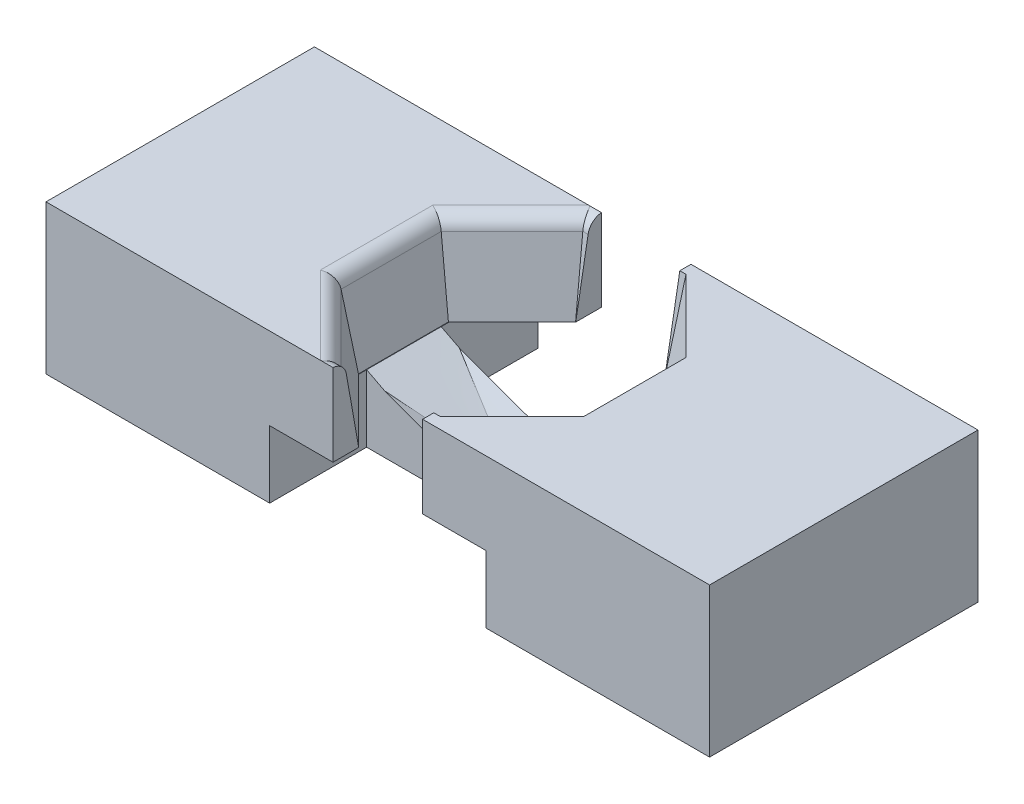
ISO-10303-21;
HEADER;
FILE_DESCRIPTION(('STEP AP214'),'2;1');
FILE_NAME('part.step','',(''),(''),'','','');
FILE_SCHEMA(('AUTOMOTIVE_DESIGN { 1 0 10303 214 1 1 1 1 }'));
ENDSEC;
DATA;
#1=APPLICATION_CONTEXT('core data for automotive mechanical design processes');
#2=APPLICATION_PROTOCOL_DEFINITION('international standard','automotive_design',2000,#1);
#3=PRODUCT_CONTEXT('',#1,'mechanical');
#4=PRODUCT('Part','Part','',(#3));
#5=PRODUCT_RELATED_PRODUCT_CATEGORY('part','',(#4));
#6=PRODUCT_DEFINITION_FORMATION('','',#4);
#7=PRODUCT_DEFINITION_CONTEXT('part definition',#1,'design');
#8=PRODUCT_DEFINITION('design','',#6,#7);
#9=PRODUCT_DEFINITION_SHAPE('','',#8);
#10=(LENGTH_UNIT() NAMED_UNIT(*) SI_UNIT(.MILLI.,.METRE.));
#11=(NAMED_UNIT(*) PLANE_ANGLE_UNIT() SI_UNIT($,.RADIAN.));
#12=(NAMED_UNIT(*) SI_UNIT($,.STERADIAN.) SOLID_ANGLE_UNIT());
#13=UNCERTAINTY_MEASURE_WITH_UNIT(LENGTH_MEASURE(1.E-05),#10,'distance_accuracy_value','');
#14=(GEOMETRIC_REPRESENTATION_CONTEXT(3) GLOBAL_UNCERTAINTY_ASSIGNED_CONTEXT((#13)) GLOBAL_UNIT_ASSIGNED_CONTEXT((#10,
#11,#12)) REPRESENTATION_CONTEXT('',''));
#15=CARTESIAN_POINT('',(0.,0.,0.));
#16=DIRECTION('',(0.,0.,1.));
#17=DIRECTION('',(1.,0.,0.));
#18=AXIS2_PLACEMENT_3D('',#15,#16,#17);
#19=CARTESIAN_POINT('',(-7.25,0.,-3.00304832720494));
#20=DIRECTION('',(1.,0.,0.));
#21=DIRECTION('',(0.,0.,-1.));
#22=AXIS2_PLACEMENT_3D('',#19,#20,#21);
#23=PLANE('',#22);
#24=DIRECTION('',(0.,1.,0.));
#25=VECTOR('',#24,1.);
#26=CARTESIAN_POINT('',(-7.25,-10.,2.5));
#27=LINE('',#26,#25);
#28=CARTESIAN_POINT('',(-7.25,-10.,2.5));
#29=VERTEX_POINT('',#28);
#30=CARTESIAN_POINT('',(-7.25,-5.5,2.5));
#31=VERTEX_POINT('',#30);
#32=EDGE_CURVE('E473',#29,#31,#27,.T.);
#33=ORIENTED_EDGE('',*,*,#32,.T.);
#34=DIRECTION('',(0.,0.,1.));
#35=VECTOR('',#34,1.);
#36=CARTESIAN_POINT('',(-7.25,-5.5,9.));
#37=LINE('',#36,#35);
#38=CARTESIAN_POINT('',(-7.25,-5.5,3.04575984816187));
#39=VERTEX_POINT('',#38);
#40=EDGE_CURVE('E498',#31,#39,#37,.T.);
#41=ORIENTED_EDGE('',*,*,#40,.T.);
#42=CARTESIAN_POINT('',(-7.25,-5.5,9.));
#43=VERTEX_POINT('',#42);
#44=EDGE_CURVE('E742',#39,#43,#37,.T.);
#45=ORIENTED_EDGE('',*,*,#44,.T.);
#46=DIRECTION('',(0.,1.,0.));
#47=VECTOR('',#46,1.);
#48=CARTESIAN_POINT('',(-7.25,-10.,9.));
#49=LINE('',#48,#47);
#50=CARTESIAN_POINT('',(-7.25,-10.,9.));
#51=VERTEX_POINT('',#50);
#52=EDGE_CURVE('E773',#51,#43,#49,.T.);
#53=ORIENTED_EDGE('',*,*,#52,.F.);
#54=DIRECTION('',(0.,0.,1.));
#55=VECTOR('',#54,1.);
#56=CARTESIAN_POINT('',(-7.25,-10.,9.));
#57=LINE('',#56,#55);
#58=EDGE_CURVE('E760',#29,#51,#57,.T.);
#59=ORIENTED_EDGE('',*,*,#58,.F.);
#60=EDGE_LOOP('',(#33,#41,#45,#53,#59));
#61=FACE_BOUND('',#60,.T.);
#62=ADVANCED_FACE('F47',(#61),#23,.T.);
#63=CARTESIAN_POINT('',(7.25,0.,3.00304832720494));
#64=DIRECTION('',(-1.,0.,0.));
#65=DIRECTION('',(0.,0.,1.));
#66=AXIS2_PLACEMENT_3D('',#63,#64,#65);
#67=PLANE('',#66);
#68=DIRECTION('',(0.,1.,0.));
#69=VECTOR('',#68,1.);
#70=CARTESIAN_POINT('',(7.25,-10.,-2.5));
#71=LINE('',#70,#69);
#72=CARTESIAN_POINT('',(7.25,-10.,-2.5));
#73=VERTEX_POINT('',#72);
#74=CARTESIAN_POINT('',(7.25,-5.5,-2.5));
#75=VERTEX_POINT('',#74);
#76=EDGE_CURVE('E715',#73,#75,#71,.T.);
#77=ORIENTED_EDGE('',*,*,#76,.T.);
#78=DIRECTION('',(0.,0.,-1.));
#79=VECTOR('',#78,1.);
#80=CARTESIAN_POINT('',(7.25,-5.5,-9.));
#81=LINE('',#80,#79);
#82=CARTESIAN_POINT('',(7.25,-5.5,-3.04575984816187));
#83=VERTEX_POINT('',#82);
#84=EDGE_CURVE('E507',#75,#83,#81,.T.);
#85=ORIENTED_EDGE('',*,*,#84,.T.);
#86=CARTESIAN_POINT('',(7.25,-5.5,-9.));
#87=VERTEX_POINT('',#86);
#88=EDGE_CURVE('E497',#83,#87,#81,.T.);
#89=ORIENTED_EDGE('',*,*,#88,.T.);
#90=DIRECTION('',(0.,1.,0.));
#91=VECTOR('',#90,1.);
#92=CARTESIAN_POINT('',(7.25,-10.,-9.));
#93=LINE('',#92,#91);
#94=CARTESIAN_POINT('',(7.25,-10.,-9.));
#95=VERTEX_POINT('',#94);
#96=EDGE_CURVE('E719',#95,#87,#93,.T.);
#97=ORIENTED_EDGE('',*,*,#96,.F.);
#98=DIRECTION('',(0.,0.,-1.));
#99=VECTOR('',#98,1.);
#100=CARTESIAN_POINT('',(7.25,-10.,-9.));
#101=LINE('',#100,#99);
#102=EDGE_CURVE('E483',#73,#95,#101,.T.);
#103=ORIENTED_EDGE('',*,*,#102,.F.);
#104=EDGE_LOOP('',(#77,#85,#89,#97,#103));
#105=FACE_BOUND('',#104,.T.);
#106=ADVANCED_FACE('F1176',(#105),#67,.T.);
#107=CARTESIAN_POINT('',(0.,0.,0.));
#108=DIRECTION('',(0.,-1.,0.));
#109=DIRECTION('',(0.,0.,-1.));
#110=AXIS2_PLACEMENT_3D('',#107,#108,#109);
#111=PLANE('',#110);
#112=DIRECTION('',(1.,0.,0.));
#113=VECTOR('',#112,1.);
#114=CARTESIAN_POINT('',(-22.25,0.,9.));
#115=LINE('',#114,#113);
#116=CARTESIAN_POINT('',(-22.25,0.,9.));
#117=VERTEX_POINT('',#116);
#118=CARTESIAN_POINT('',(-3.85392796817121,0.,9.));
#119=VERTEX_POINT('',#118);
#120=EDGE_CURVE('E814',#117,#119,#115,.T.);
#121=ORIENTED_EDGE('',*,*,#120,.T.);
#122=DIRECTION('',(0.707106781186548,0.,0.707106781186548));
#123=VECTOR('',#122,1.);
#124=CARTESIAN_POINT('',(-6.4269639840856,0.,6.4269639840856));
#125=LINE('',#124,#123);
#126=CARTESIAN_POINT('',(-9.08909963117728,0.,3.76482833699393));
#127=VERTEX_POINT('',#126);
#128=EDGE_CURVE('E1316',#119,#127,#125,.F.);
#129=ORIENTED_EDGE('',*,*,#128,.T.);
#130=DIRECTION('',(0.,0.,1.));
#131=VECTOR('',#130,1.);
#132=CARTESIAN_POINT('',(-9.08909963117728,0.,0.));
#133=LINE('',#132,#131);
#134=CARTESIAN_POINT('',(-9.08909963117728,0.,-3.76482833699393));
#135=VERTEX_POINT('',#134);
#136=EDGE_CURVE('E1360',#127,#135,#133,.F.);
#137=ORIENTED_EDGE('',*,*,#136,.T.);
#138=DIRECTION('',(-0.707106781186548,0.,0.707106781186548));
#139=VECTOR('',#138,1.);
#140=CARTESIAN_POINT('',(-6.4269639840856,0.,-6.4269639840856));
#141=LINE('',#140,#139);
#142=CARTESIAN_POINT('',(-3.85392796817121,0.,-9.));
#143=VERTEX_POINT('',#142);
#144=EDGE_CURVE('E1357',#135,#143,#141,.F.);
#145=ORIENTED_EDGE('',*,*,#144,.T.);
#146=DIRECTION('',(-1.,0.,0.));
#147=VECTOR('',#146,1.);
#148=CARTESIAN_POINT('',(-22.25,0.,-9.));
#149=LINE('',#148,#147);
#150=CARTESIAN_POINT('',(-22.25,0.,-9.));
#151=VERTEX_POINT('',#150);
#152=EDGE_CURVE('E830',#143,#151,#149,.T.);
#153=ORIENTED_EDGE('',*,*,#152,.T.);
#154=DIRECTION('',(0.,0.,1.));
#155=VECTOR('',#154,1.);
#156=CARTESIAN_POINT('',(-22.25,0.,9.));
#157=LINE('',#156,#155);
#158=EDGE_CURVE('E836',#151,#117,#157,.T.);
#159=ORIENTED_EDGE('',*,*,#158,.T.);
#160=EDGE_LOOP('',(#121,#129,#137,#145,#153,#159));
#161=FACE_BOUND('',#160,.T.);
#162=ADVANCED_FACE('F1184',(#161),#111,.F.);
#163=DIRECTION('',(0.,0.,-1.));
#164=VECTOR('',#163,1.);
#165=CARTESIAN_POINT('',(3.00304832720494,0.,0.));
#166=LINE('',#165,#164);
#167=CARTESIAN_POINT('',(3.00304832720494,0.,-8.25));
#168=VERTEX_POINT('',#167);
#169=CARTESIAN_POINT('',(3.00304832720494,0.,-9.));
#170=VERTEX_POINT('',#169);
#171=EDGE_CURVE('E451',#168,#170,#166,.T.);
#172=ORIENTED_EDGE('',*,*,#171,.F.);
#173=DIRECTION('',(-1.,0.,0.));
#174=VECTOR('',#173,1.);
#175=CARTESIAN_POINT('',(3.41726188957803,0.,-8.25));
#176=LINE('',#175,#174);
#177=CARTESIAN_POINT('',(3.41726188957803,0.,-8.25));
#178=VERTEX_POINT('',#177);
#179=EDGE_CURVE('E1251',#178,#168,#176,.T.);
#180=ORIENTED_EDGE('',*,*,#179,.F.);
#181=DIRECTION('',(-0.707106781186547,0.,-0.707106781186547));
#182=VECTOR('',#181,1.);
#183=CARTESIAN_POINT('',(8.25,0.,-3.41726188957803));
#184=LINE('',#183,#182);
#185=CARTESIAN_POINT('',(8.25,0.,-3.41726188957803));
#186=VERTEX_POINT('',#185);
#187=EDGE_CURVE('E356',#186,#178,#184,.T.);
#188=ORIENTED_EDGE('',*,*,#187,.F.);
#189=DIRECTION('',(0.,0.,-1.));
#190=VECTOR('',#189,1.);
#191=CARTESIAN_POINT('',(8.25,0.,3.41726188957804));
#192=LINE('',#191,#190);
#193=CARTESIAN_POINT('',(8.25,0.,3.41726188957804));
#194=VERTEX_POINT('',#193);
#195=EDGE_CURVE('E346',#194,#186,#192,.T.);
#196=ORIENTED_EDGE('',*,*,#195,.F.);
#197=DIRECTION('',(0.707106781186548,0.,-0.707106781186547));
#198=VECTOR('',#197,1.);
#199=CARTESIAN_POINT('',(3.41726188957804,0.,8.25));
#200=LINE('',#199,#198);
#201=CARTESIAN_POINT('',(3.41726188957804,0.,8.25));
#202=VERTEX_POINT('',#201);
#203=EDGE_CURVE('E352',#202,#194,#200,.T.);
#204=ORIENTED_EDGE('',*,*,#203,.F.);
#205=DIRECTION('',(1.,0.,0.));
#206=VECTOR('',#205,1.);
#207=CARTESIAN_POINT('',(-3.41726188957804,0.,8.25));
#208=LINE('',#207,#206);
#209=CARTESIAN_POINT('',(3.00304832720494,0.,8.25));
#210=VERTEX_POINT('',#209);
#211=EDGE_CURVE('E1257',#210,#202,#208,.T.);
#212=ORIENTED_EDGE('',*,*,#211,.F.);
#213=DIRECTION('',(0.,0.,-1.));
#214=VECTOR('',#213,1.);
#215=CARTESIAN_POINT('',(3.00304832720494,0.,0.));
#216=LINE('',#215,#214);
#217=CARTESIAN_POINT('',(3.00304832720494,0.,9.));
#218=VERTEX_POINT('',#217);
#219=EDGE_CURVE('E469',#218,#210,#216,.T.);
#220=ORIENTED_EDGE('',*,*,#219,.F.);
#221=CARTESIAN_POINT('',(22.25,0.,9.));
#222=VERTEX_POINT('',#221);
#223=EDGE_CURVE('E841',#218,#222,#115,.T.);
#224=ORIENTED_EDGE('',*,*,#223,.T.);
#225=DIRECTION('',(0.,0.,-1.));
#226=VECTOR('',#225,1.);
#227=CARTESIAN_POINT('',(22.25,0.,9.));
#228=LINE('',#227,#226);
#229=CARTESIAN_POINT('',(22.25,0.,-9.));
#230=VERTEX_POINT('',#229);
#231=EDGE_CURVE('E826',#222,#230,#228,.T.);
#232=ORIENTED_EDGE('',*,*,#231,.T.);
#233=EDGE_CURVE('E832',#230,#170,#149,.T.);
#234=ORIENTED_EDGE('',*,*,#233,.T.);
#235=EDGE_LOOP('',(#172,#180,#188,#196,#204,#212,#220,#224,#232,#234));
#236=FACE_BOUND('',#235,.T.);
#237=ADVANCED_FACE('F1205',(#236),#111,.F.);
#238=CARTESIAN_POINT('',(-22.25,-10.,9.));
#239=DIRECTION('',(0.,0.,1.));
#240=DIRECTION('',(1.,0.,0.));
#241=AXIS2_PLACEMENT_3D('',#238,#239,#240);
#242=PLANE('',#241);
#243=DIRECTION('',(1.,0.,0.));
#244=VECTOR('',#243,1.);
#245=CARTESIAN_POINT('',(-7.25,-5.5,9.));
#246=LINE('',#245,#244);
#247=CARTESIAN_POINT('',(-3.00304832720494,-5.5,9.));
#248=VERTEX_POINT('',#247);
#249=EDGE_CURVE('E746',#43,#248,#246,.T.);
#250=ORIENTED_EDGE('',*,*,#249,.T.);
#251=DIRECTION('',(0.,-1.,0.));
#252=VECTOR('',#251,1.);
#253=CARTESIAN_POINT('',(-3.00304832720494,2.49999999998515E-05,9.));
#254=LINE('',#253,#252);
#255=CARTESIAN_POINT('',(-3.00304832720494,0.,9.));
#256=VERTEX_POINT('',#255);
#257=EDGE_CURVE('E452',#256,#248,#254,.T.);
#258=ORIENTED_EDGE('',*,*,#257,.F.);
#259=EDGE_CURVE('E845',#119,#256,#115,.T.);
#260=ORIENTED_EDGE('',*,*,#259,.F.);
#261=ORIENTED_EDGE('',*,*,#120,.F.);
#262=DIRECTION('',(0.,1.,0.));
#263=VECTOR('',#262,1.);
#264=CARTESIAN_POINT('',(-22.25,-10.,9.));
#265=LINE('',#264,#263);
#266=CARTESIAN_POINT('',(-22.25,-10.,9.));
#267=VERTEX_POINT('',#266);
#268=EDGE_CURVE('E851',#267,#117,#265,.T.);
#269=ORIENTED_EDGE('',*,*,#268,.F.);
#270=DIRECTION('',(1.,0.,0.));
#271=VECTOR('',#270,1.);
#272=CARTESIAN_POINT('',(-22.25,-10.,9.));
#273=LINE('',#272,#271);
#274=EDGE_CURVE('E821',#267,#51,#273,.T.);
#275=ORIENTED_EDGE('',*,*,#274,.T.);
#276=ORIENTED_EDGE('',*,*,#52,.T.);
#277=EDGE_LOOP('',(#250,#258,#260,#261,#269,#275,#276));
#278=FACE_BOUND('',#277,.T.);
#279=ADVANCED_FACE('F1207',(#278),#242,.T.);
#280=ORIENTED_EDGE('',*,*,#223,.F.);
#281=DIRECTION('',(0.,-1.,0.));
#282=VECTOR('',#281,1.);
#283=CARTESIAN_POINT('',(3.00304832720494,2.49999999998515E-05,9.));
#284=LINE('',#283,#282);
#285=CARTESIAN_POINT('',(3.00304832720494,-5.5,9.));
#286=VERTEX_POINT('',#285);
#287=EDGE_CURVE('E456',#218,#286,#284,.T.);
#288=ORIENTED_EDGE('',*,*,#287,.T.);
#289=CARTESIAN_POINT('',(7.25,-5.5,9.));
#290=VERTEX_POINT('',#289);
#291=EDGE_CURVE('E765',#286,#290,#246,.T.);
#292=ORIENTED_EDGE('',*,*,#291,.T.);
#293=DIRECTION('',(0.,1.,0.));
#294=VECTOR('',#293,1.);
#295=CARTESIAN_POINT('',(7.25,-10.,9.));
#296=LINE('',#295,#294);
#297=CARTESIAN_POINT('',(7.25,-10.,9.));
#298=VERTEX_POINT('',#297);
#299=EDGE_CURVE('E707',#298,#290,#296,.T.);
#300=ORIENTED_EDGE('',*,*,#299,.F.);
#301=CARTESIAN_POINT('',(22.25,-10.,9.));
#302=VERTEX_POINT('',#301);
#303=EDGE_CURVE('E820',#298,#302,#273,.T.);
#304=ORIENTED_EDGE('',*,*,#303,.T.);
#305=DIRECTION('',(0.,1.,0.));
#306=VECTOR('',#305,1.);
#307=CARTESIAN_POINT('',(22.25,-10.,9.));
#308=LINE('',#307,#306);
#309=EDGE_CURVE('E846',#302,#222,#308,.T.);
#310=ORIENTED_EDGE('',*,*,#309,.T.);
#311=EDGE_LOOP('',(#280,#288,#292,#300,#304,#310));
#312=FACE_BOUND('',#311,.T.);
#313=ADVANCED_FACE('F1209',(#312),#242,.T.);
#314=CARTESIAN_POINT('',(-22.25,-10.,-9.));
#315=DIRECTION('',(0.,0.,-1.));
#316=DIRECTION('',(-1.,0.,0.));
#317=AXIS2_PLACEMENT_3D('',#314,#315,#316);
#318=PLANE('',#317);
#319=CARTESIAN_POINT('',(-3.00304832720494,0.,-9.));
#320=VERTEX_POINT('',#319);
#321=EDGE_CURVE('E837',#320,#143,#149,.T.);
#322=ORIENTED_EDGE('',*,*,#321,.F.);
#323=DIRECTION('',(0.,-1.,0.));
#324=VECTOR('',#323,1.);
#325=CARTESIAN_POINT('',(-3.00304832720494,2.49999999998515E-05,-9.));
#326=LINE('',#325,#324);
#327=CARTESIAN_POINT('',(-3.00304832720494,-5.5,-9.));
#328=VERTEX_POINT('',#327);
#329=EDGE_CURVE('E443',#320,#328,#326,.T.);
#330=ORIENTED_EDGE('',*,*,#329,.T.);
#331=DIRECTION('',(-1.,0.,0.));
#332=VECTOR('',#331,1.);
#333=CARTESIAN_POINT('',(-7.25,-5.5,-9.));
#334=LINE('',#333,#332);
#335=CARTESIAN_POINT('',(-7.25,-5.5,-9.));
#336=VERTEX_POINT('',#335);
#337=EDGE_CURVE('E511',#328,#336,#334,.T.);
#338=ORIENTED_EDGE('',*,*,#337,.T.);
#339=DIRECTION('',(0.,1.,0.));
#340=VECTOR('',#339,1.);
#341=CARTESIAN_POINT('',(-7.25,-10.,-9.));
#342=LINE('',#341,#340);
#343=CARTESIAN_POINT('',(-7.25,-10.,-9.));
#344=VERTEX_POINT('',#343);
#345=EDGE_CURVE('E780',#344,#336,#342,.T.);
#346=ORIENTED_EDGE('',*,*,#345,.F.);
#347=DIRECTION('',(-1.,0.,0.));
#348=VECTOR('',#347,1.);
#349=CARTESIAN_POINT('',(-22.25,-10.,-9.));
#350=LINE('',#349,#348);
#351=CARTESIAN_POINT('',(-22.25,-10.,-9.));
#352=VERTEX_POINT('',#351);
#353=EDGE_CURVE('E800',#344,#352,#350,.T.);
#354=ORIENTED_EDGE('',*,*,#353,.T.);
#355=DIRECTION('',(0.,1.,0.));
#356=VECTOR('',#355,1.);
#357=CARTESIAN_POINT('',(-22.25,-10.,-9.));
#358=LINE('',#357,#356);
#359=EDGE_CURVE('E854',#352,#151,#358,.T.);
#360=ORIENTED_EDGE('',*,*,#359,.T.);
#361=ORIENTED_EDGE('',*,*,#152,.F.);
#362=EDGE_LOOP('',(#322,#330,#338,#346,#354,#360,#361));
#363=FACE_BOUND('',#362,.T.);
#364=ADVANCED_FACE('F792',(#363),#318,.T.);
#365=CARTESIAN_POINT('',(3.00304832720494,-5.5,-9.));
#366=VERTEX_POINT('',#365);
#367=EDGE_CURVE('E479',#87,#366,#334,.T.);
#368=ORIENTED_EDGE('',*,*,#367,.T.);
#369=DIRECTION('',(0.,-1.,0.));
#370=VECTOR('',#369,1.);
#371=CARTESIAN_POINT('',(3.00304832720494,2.49999999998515E-05,-9.));
#372=LINE('',#371,#370);
#373=EDGE_CURVE('E447',#170,#366,#372,.T.);
#374=ORIENTED_EDGE('',*,*,#373,.F.);
#375=ORIENTED_EDGE('',*,*,#233,.F.);
#376=DIRECTION('',(0.,1.,0.));
#377=VECTOR('',#376,1.);
#378=CARTESIAN_POINT('',(22.25,-10.,-9.));
#379=LINE('',#378,#377);
#380=CARTESIAN_POINT('',(22.25,-10.,-9.));
#381=VERTEX_POINT('',#380);
#382=EDGE_CURVE('E825',#381,#230,#379,.T.);
#383=ORIENTED_EDGE('',*,*,#382,.F.);
#384=EDGE_CURVE('E807',#381,#95,#350,.T.);
#385=ORIENTED_EDGE('',*,*,#384,.T.);
#386=ORIENTED_EDGE('',*,*,#96,.T.);
#387=EDGE_LOOP('',(#368,#374,#375,#383,#385,#386));
#388=FACE_BOUND('',#387,.T.);
#389=ADVANCED_FACE('F1214',(#388),#318,.T.);
#390=CARTESIAN_POINT('',(0.,-5.5,0.));
#391=DIRECTION('',(0.,-1.,0.));
#392=DIRECTION('',(0.,0.,-1.));
#393=AXIS2_PLACEMENT_3D('',#390,#391,#392);
#394=PLANE('',#393);
#395=DIRECTION('',(0.707106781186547,0.,0.707106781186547));
#396=VECTOR('',#395,1.);
#397=CARTESIAN_POINT('',(-7.56424897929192,-5.5,2.73151086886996));
#398=LINE('',#397,#396);
#399=CARTESIAN_POINT('',(-3.01555824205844,-5.5,7.28020160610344));
#400=VERTEX_POINT('',#399);
#401=EDGE_CURVE('E386',#39,#400,#398,.T.);
#402=ORIENTED_EDGE('',*,*,#401,.T.);
#403=DIRECTION('',(1.,0.,0.));
#404=VECTOR('',#403,1.);
#405=CARTESIAN_POINT('',(-3.41726188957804,-5.5,7.28020160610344));
#406=LINE('',#405,#404);
#407=CARTESIAN_POINT('',(-3.00304832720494,-5.5,7.28020160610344));
#408=VERTEX_POINT('',#407);
#409=EDGE_CURVE('E375',#400,#408,#406,.T.);
#410=ORIENTED_EDGE('',*,*,#409,.T.);
#411=DIRECTION('',(0.,0.,1.));
#412=VECTOR('',#411,1.);
#413=CARTESIAN_POINT('',(-3.00304832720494,-5.5,7.25));
#414=LINE('',#413,#412);
#415=EDGE_CURVE('E440',#408,#248,#414,.T.);
#416=ORIENTED_EDGE('',*,*,#415,.T.);
#417=ORIENTED_EDGE('',*,*,#249,.F.);
#418=ORIENTED_EDGE('',*,*,#44,.F.);
#419=EDGE_LOOP('',(#402,#410,#416,#417,#418));
#420=FACE_BOUND('',#419,.T.);
#421=ADVANCED_FACE('F580',(#420),#394,.T.);
#422=CARTESIAN_POINT('',(3.00304832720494,-5.5,7.28020160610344));
#423=VERTEX_POINT('',#422);
#424=CARTESIAN_POINT('',(3.01555824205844,-5.5,7.28020160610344));
#425=VERTEX_POINT('',#424);
#426=EDGE_CURVE('E380',#423,#425,#406,.T.);
#427=ORIENTED_EDGE('',*,*,#426,.T.);
#428=DIRECTION('',(0.707106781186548,0.,-0.707106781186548));
#429=VECTOR('',#428,1.);
#430=CARTESIAN_POINT('',(2.73151086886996,-5.5,7.56424897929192));
#431=LINE('',#430,#429);
#432=CARTESIAN_POINT('',(7.25,-5.5,3.04575984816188));
#433=VERTEX_POINT('',#432);
#434=EDGE_CURVE('E370',#425,#433,#431,.T.);
#435=ORIENTED_EDGE('',*,*,#434,.T.);
#436=DIRECTION('',(0.,0.,-1.));
#437=VECTOR('',#436,1.);
#438=CARTESIAN_POINT('',(7.25,-5.5,9.));
#439=LINE('',#438,#437);
#440=EDGE_CURVE('E761',#290,#433,#439,.T.);
#441=ORIENTED_EDGE('',*,*,#440,.F.);
#442=ORIENTED_EDGE('',*,*,#291,.F.);
#443=DIRECTION('',(0.,0.,-1.));
#444=VECTOR('',#443,1.);
#445=CARTESIAN_POINT('',(3.00304832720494,-5.5,7.25));
#446=LINE('',#445,#444);
#447=EDGE_CURVE('E461',#286,#423,#446,.T.);
#448=ORIENTED_EDGE('',*,*,#447,.T.);
#449=EDGE_LOOP('',(#427,#435,#441,#442,#448));
#450=FACE_BOUND('',#449,.T.);
#451=ADVANCED_FACE('F1402',(#450),#394,.T.);
#452=CARTESIAN_POINT('',(0.,-5.5,0.));
#453=DIRECTION('',(0.,1.,0.));
#454=DIRECTION('',(0.,0.,1.));
#455=AXIS2_PLACEMENT_3D('',#452,#453,#454);
#456=PLANE('',#455);
#457=DIRECTION('',(0.,0.,1.));
#458=VECTOR('',#457,1.);
#459=CARTESIAN_POINT('',(-3.00304832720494,-5.5,-7.25));
#460=LINE('',#459,#458);
#461=CARTESIAN_POINT('',(-3.00304832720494,-5.5,-7.28020160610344));
#462=VERTEX_POINT('',#461);
#463=EDGE_CURVE('E344',#328,#462,#460,.T.);
#464=ORIENTED_EDGE('',*,*,#463,.T.);
#465=DIRECTION('',(-1.,0.,0.));
#466=VECTOR('',#465,1.);
#467=CARTESIAN_POINT('',(3.41726188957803,-5.5,-7.28020160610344));
#468=LINE('',#467,#466);
#469=CARTESIAN_POINT('',(-3.01555824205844,-5.5,-7.28020160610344));
#470=VERTEX_POINT('',#469);
#471=EDGE_CURVE('E335',#462,#470,#468,.T.);
#472=ORIENTED_EDGE('',*,*,#471,.T.);
#473=DIRECTION('',(-0.707106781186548,0.,0.707106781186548));
#474=VECTOR('',#473,1.);
#475=CARTESIAN_POINT('',(-2.73151086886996,-5.5,-7.56424897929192));
#476=LINE('',#475,#474);
#477=CARTESIAN_POINT('',(-7.25,-5.5,-3.04575984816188));
#478=VERTEX_POINT('',#477);
#479=EDGE_CURVE('E320',#470,#478,#476,.T.);
#480=ORIENTED_EDGE('',*,*,#479,.T.);
#481=DIRECTION('',(0.,0.,1.));
#482=VECTOR('',#481,1.);
#483=CARTESIAN_POINT('',(-7.25,-5.5,-9.));
#484=LINE('',#483,#482);
#485=EDGE_CURVE('E493',#336,#478,#484,.T.);
#486=ORIENTED_EDGE('',*,*,#485,.F.);
#487=ORIENTED_EDGE('',*,*,#337,.F.);
#488=EDGE_LOOP('',(#464,#472,#480,#486,#487));
#489=FACE_BOUND('',#488,.T.);
#490=ADVANCED_FACE('F342',(#489),#456,.F.);
#491=DIRECTION('',(-0.707106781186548,0.,-0.707106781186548));
#492=VECTOR('',#491,1.);
#493=CARTESIAN_POINT('',(7.56424897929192,-5.5,-2.73151086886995));
#494=LINE('',#493,#492);
#495=CARTESIAN_POINT('',(3.01555824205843,-5.5,-7.28020160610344));
#496=VERTEX_POINT('',#495);
#497=EDGE_CURVE('E363',#83,#496,#494,.T.);
#498=ORIENTED_EDGE('',*,*,#497,.T.);
#499=CARTESIAN_POINT('',(3.00304832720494,-5.5,-7.28020160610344));
#500=VERTEX_POINT('',#499);
#501=EDGE_CURVE('E339',#496,#500,#468,.T.);
#502=ORIENTED_EDGE('',*,*,#501,.T.);
#503=DIRECTION('',(0.,0.,-1.));
#504=VECTOR('',#503,1.);
#505=CARTESIAN_POINT('',(3.00304832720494,-5.5,-7.25));
#506=LINE('',#505,#504);
#507=EDGE_CURVE('E439',#500,#366,#506,.T.);
#508=ORIENTED_EDGE('',*,*,#507,.T.);
#509=ORIENTED_EDGE('',*,*,#367,.F.);
#510=ORIENTED_EDGE('',*,*,#88,.F.);
#511=EDGE_LOOP('',(#498,#502,#508,#509,#510));
#512=FACE_BOUND('',#511,.T.);
#513=ADVANCED_FACE('F1217',(#512),#456,.F.);
#514=CARTESIAN_POINT('',(22.25,-10.,9.));
#515=DIRECTION('',(1.,0.,0.));
#516=DIRECTION('',(0.,0.,-1.));
#517=AXIS2_PLACEMENT_3D('',#514,#515,#516);
#518=PLANE('',#517);
#519=ORIENTED_EDGE('',*,*,#231,.F.);
#520=ORIENTED_EDGE('',*,*,#309,.F.);
#521=DIRECTION('',(0.,0.,-1.));
#522=VECTOR('',#521,1.);
#523=CARTESIAN_POINT('',(22.25,-10.,9.));
#524=LINE('',#523,#522);
#525=EDGE_CURVE('E808',#302,#381,#524,.T.);
#526=ORIENTED_EDGE('',*,*,#525,.T.);
#527=ORIENTED_EDGE('',*,*,#382,.T.);
#528=EDGE_LOOP('',(#519,#520,#526,#527));
#529=FACE_BOUND('',#528,.T.);
#530=ADVANCED_FACE('F1198',(#529),#518,.T.);
#531=CARTESIAN_POINT('',(-22.25,-10.,9.));
#532=DIRECTION('',(-1.,0.,0.));
#533=DIRECTION('',(0.,0.,1.));
#534=AXIS2_PLACEMENT_3D('',#531,#532,#533);
#535=PLANE('',#534);
#536=ORIENTED_EDGE('',*,*,#158,.F.);
#537=ORIENTED_EDGE('',*,*,#359,.F.);
#538=DIRECTION('',(0.,0.,1.));
#539=VECTOR('',#538,1.);
#540=CARTESIAN_POINT('',(-22.25,-10.,9.));
#541=LINE('',#540,#539);
#542=EDGE_CURVE('E803',#352,#267,#541,.T.);
#543=ORIENTED_EDGE('',*,*,#542,.T.);
#544=ORIENTED_EDGE('',*,*,#268,.T.);
#545=EDGE_LOOP('',(#536,#537,#543,#544));
#546=FACE_BOUND('',#545,.T.);
#547=ADVANCED_FACE('F1192',(#546),#535,.T.);
#548=CARTESIAN_POINT('',(0.,-10.,0.));
#549=DIRECTION('',(0.,-1.,0.));
#550=DIRECTION('',(0.,0.,-1.));
#551=AXIS2_PLACEMENT_3D('',#548,#549,#550);
#552=PLANE('',#551);
#553=CARTESIAN_POINT('',(16.5,-10.,0.));
#554=DIRECTION('',(0.,-1.,0.));
#555=DIRECTION('',(0.,0.,-1.));
#556=AXIS2_PLACEMENT_3D('',#553,#554,#555);
#557=CIRCLE('',#556,1.5);
#558=CARTESIAN_POINT('',(16.5,-10.,-1.5));
#559=VERTEX_POINT('',#558);
#560=EDGE_CURVE('E457',#559,#559,#557,.F.);
#561=ORIENTED_EDGE('',*,*,#560,.T.);
#562=EDGE_LOOP('',(#561));
#563=FACE_BOUND('',#562,.T.);
#564=CARTESIAN_POINT('',(-16.5,-10.,0.));
#565=DIRECTION('',(0.,-1.,0.));
#566=DIRECTION('',(0.,0.,-1.));
#567=AXIS2_PLACEMENT_3D('',#564,#565,#566);
#568=CIRCLE('',#567,1.5);
#569=CARTESIAN_POINT('',(-16.5,-10.,-1.49999999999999));
#570=VERTEX_POINT('',#569);
#571=EDGE_CURVE('E433',#570,#570,#568,.F.);
#572=ORIENTED_EDGE('',*,*,#571,.T.);
#573=EDGE_LOOP('',(#572));
#574=FACE_BOUND('',#573,.T.);
#575=DIRECTION('',(0.,0.,1.));
#576=VECTOR('',#575,1.);
#577=CARTESIAN_POINT('',(-7.25,-10.,-9.));
#578=LINE('',#577,#576);
#579=CARTESIAN_POINT('',(-7.25,-10.,-2.5));
#580=VERTEX_POINT('',#579);
#581=EDGE_CURVE('E474',#344,#580,#578,.T.);
#582=ORIENTED_EDGE('',*,*,#581,.T.);
#583=DIRECTION('',(1.,0.,0.));
#584=VECTOR('',#583,1.);
#585=CARTESIAN_POINT('',(-7.25,-10.,-2.5));
#586=LINE('',#585,#584);
#587=EDGE_CURVE('E478',#580,#73,#586,.T.);
#588=ORIENTED_EDGE('',*,*,#587,.T.);
#589=ORIENTED_EDGE('',*,*,#102,.T.);
#590=ORIENTED_EDGE('',*,*,#384,.F.);
#591=ORIENTED_EDGE('',*,*,#525,.F.);
#592=ORIENTED_EDGE('',*,*,#303,.F.);
#593=DIRECTION('',(0.,0.,-1.));
#594=VECTOR('',#593,1.);
#595=CARTESIAN_POINT('',(7.25,-10.,9.));
#596=LINE('',#595,#594);
#597=CARTESIAN_POINT('',(7.25,-10.,2.5));
#598=VERTEX_POINT('',#597);
#599=EDGE_CURVE('E1343',#298,#598,#596,.T.);
#600=ORIENTED_EDGE('',*,*,#599,.T.);
#601=DIRECTION('',(-1.,0.,0.));
#602=VECTOR('',#601,1.);
#603=CARTESIAN_POINT('',(-7.25,-10.,2.5));
#604=LINE('',#603,#602);
#605=EDGE_CURVE('E752',#598,#29,#604,.T.);
#606=ORIENTED_EDGE('',*,*,#605,.T.);
#607=ORIENTED_EDGE('',*,*,#58,.T.);
#608=ORIENTED_EDGE('',*,*,#274,.F.);
#609=ORIENTED_EDGE('',*,*,#542,.F.);
#610=ORIENTED_EDGE('',*,*,#353,.F.);
#611=EDGE_LOOP('',(#582,#588,#589,#590,#591,#592,#600,#606,#607,#608,#609,#610));
#612=FACE_BOUND('',#611,.T.);
#613=ADVANCED_FACE('F798',(#563,#574,#612),#552,.T.);
#614=DIRECTION('',(0.,0.,-1.));
#615=VECTOR('',#614,1.);
#616=CARTESIAN_POINT('',(-7.25,-5.5,-3.00304832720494));
#617=LINE('',#616,#615);
#618=CARTESIAN_POINT('',(-7.25,-5.5,-2.5));
#619=VERTEX_POINT('',#618);
#620=EDGE_CURVE('E419',#619,#478,#617,.T.);
#621=ORIENTED_EDGE('',*,*,#620,.F.);
#622=DIRECTION('',(0.,1.,0.));
#623=VECTOR('',#622,1.);
#624=CARTESIAN_POINT('',(-7.25,-10.,-2.5));
#625=LINE('',#624,#623);
#626=EDGE_CURVE('E487',#580,#619,#625,.T.);
#627=ORIENTED_EDGE('',*,*,#626,.F.);
#628=ORIENTED_EDGE('',*,*,#581,.F.);
#629=ORIENTED_EDGE('',*,*,#345,.T.);
#630=ORIENTED_EDGE('',*,*,#485,.T.);
#631=EDGE_LOOP('',(#621,#627,#628,#629,#630));
#632=FACE_BOUND('',#631,.T.);
#633=ADVANCED_FACE('F795',(#632),#23,.T.);
#634=DIRECTION('',(0.,0.,1.));
#635=VECTOR('',#634,1.);
#636=CARTESIAN_POINT('',(7.25,-5.5,3.00304832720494));
#637=LINE('',#636,#635);
#638=CARTESIAN_POINT('',(7.25,-5.5,2.5));
#639=VERTEX_POINT('',#638);
#640=EDGE_CURVE('E413',#639,#433,#637,.T.);
#641=ORIENTED_EDGE('',*,*,#640,.F.);
#642=DIRECTION('',(0.,1.,0.));
#643=VECTOR('',#642,1.);
#644=CARTESIAN_POINT('',(7.25,-10.,2.5));
#645=LINE('',#644,#643);
#646=EDGE_CURVE('E703',#598,#639,#645,.T.);
#647=ORIENTED_EDGE('',*,*,#646,.F.);
#648=ORIENTED_EDGE('',*,*,#599,.F.);
#649=ORIENTED_EDGE('',*,*,#299,.T.);
#650=ORIENTED_EDGE('',*,*,#440,.T.);
#651=EDGE_LOOP('',(#641,#647,#648,#649,#650));
#652=FACE_BOUND('',#651,.T.);
#653=ADVANCED_FACE('F1170',(#652),#67,.T.);
#654=CARTESIAN_POINT('',(0.,-9.,0.));
#655=DIRECTION('',(0.,1.,0.));
#656=DIRECTION('',(0.,0.,1.));
#657=AXIS2_PLACEMENT_3D('',#654,#655,#656);
#658=PLANE('',#657);
#659=CARTESIAN_POINT('',(0.179861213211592,-9.,-0.434223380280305));
#660=CARTESIAN_POINT('',(0.235251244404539,-9.,-0.411280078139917));
#661=CARTESIAN_POINT('',(0.288269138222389,-9.,-0.376411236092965));
#662=CARTESIAN_POINT('',(0.376411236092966,-9.,-0.288269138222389));
#663=CARTESIAN_POINT('',(0.411280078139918,-9.,-0.235251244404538));
#664=CARTESIAN_POINT('',(0.434223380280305,-9.,-0.179861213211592));
#665=B_SPLINE_CURVE_WITH_KNOTS('',3,(#659,#660,#661,#662,#663,#664),.UNSPECIFIED.,.F.,.F.,(4,2,
4),(0.,0.5,1.),.UNSPECIFIED.);
#666=CARTESIAN_POINT('',(0.434223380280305,-9.,-0.179861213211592));
#667=VERTEX_POINT('',#666);
#668=CARTESIAN_POINT('',(0.179861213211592,-9.,-0.434223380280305));
#669=VERTEX_POINT('',#668);
#670=EDGE_CURVE('E976',#667,#669,#665,.F.);
#671=ORIENTED_EDGE('',*,*,#670,.T.);
#672=CARTESIAN_POINT('',(-0.179861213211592,-9.,-0.434223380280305));
#673=CARTESIAN_POINT('',(-0.124471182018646,-9.,-0.457166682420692));
#674=CARTESIAN_POINT('',(-0.0623258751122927,-9.,-0.47));
#675=CARTESIAN_POINT('',(0.062325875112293,-9.,-0.47));
#676=CARTESIAN_POINT('',(0.124471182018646,-9.,-0.457166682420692));
#677=CARTESIAN_POINT('',(0.179861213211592,-9.,-0.434223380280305));
#678=B_SPLINE_CURVE_WITH_KNOTS('',3,(#672,#673,#674,#675,#676,#677),.UNSPECIFIED.,.F.,.F.,(4,2,
4),(0.,0.5,1.),.UNSPECIFIED.);
#679=CARTESIAN_POINT('',(-0.179861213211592,-9.,-0.434223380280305));
#680=VERTEX_POINT('',#679);
#681=EDGE_CURVE('E1101',#669,#680,#678,.F.);
#682=ORIENTED_EDGE('',*,*,#681,.T.);
#683=CARTESIAN_POINT('',(-0.434223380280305,-9.,-0.179861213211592));
#684=CARTESIAN_POINT('',(-0.411280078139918,-9.,-0.235251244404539));
#685=CARTESIAN_POINT('',(-0.376411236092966,-9.,-0.288269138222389));
#686=CARTESIAN_POINT('',(-0.288269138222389,-9.,-0.376411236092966));
#687=CARTESIAN_POINT('',(-0.235251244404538,-9.,-0.411280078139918));
#688=CARTESIAN_POINT('',(-0.179861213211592,-9.,-0.434223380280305));
#689=B_SPLINE_CURVE_WITH_KNOTS('',3,(#683,#684,#685,#686,#687,#688),.UNSPECIFIED.,.F.,.F.,(4,2,
4),(0.,0.5,1.),.UNSPECIFIED.);
#690=CARTESIAN_POINT('',(-0.434223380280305,-9.,-0.179861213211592));
#691=VERTEX_POINT('',#690);
#692=EDGE_CURVE('E935',#680,#691,#689,.F.);
#693=ORIENTED_EDGE('',*,*,#692,.T.);
#694=CARTESIAN_POINT('',(-0.434223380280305,-9.,0.179861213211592));
#695=CARTESIAN_POINT('',(-0.457166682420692,-9.,0.124471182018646));
#696=CARTESIAN_POINT('',(-0.47,-9.,0.0623258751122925));
#697=CARTESIAN_POINT('',(-0.47,-9.,-0.0623258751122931));
#698=CARTESIAN_POINT('',(-0.457166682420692,-9.,-0.124471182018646));
#699=CARTESIAN_POINT('',(-0.434223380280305,-9.,-0.179861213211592));
#700=B_SPLINE_CURVE_WITH_KNOTS('',3,(#694,#695,#696,#697,#698,#699),.UNSPECIFIED.,.F.,.F.,(4,2,
4),(0.,0.5,1.),.UNSPECIFIED.);
#701=CARTESIAN_POINT('',(-0.434223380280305,-9.,0.179861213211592));
#702=VERTEX_POINT('',#701);
#703=EDGE_CURVE('E931',#691,#702,#700,.F.);
#704=ORIENTED_EDGE('',*,*,#703,.T.);
#705=CARTESIAN_POINT('',(-0.179861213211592,-9.,0.434223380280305));
#706=CARTESIAN_POINT('',(-0.235251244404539,-9.,0.411280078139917));
#707=CARTESIAN_POINT('',(-0.28826913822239,-9.,0.376411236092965));
#708=CARTESIAN_POINT('',(-0.376411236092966,-9.,0.288269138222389));
#709=CARTESIAN_POINT('',(-0.411280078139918,-9.,0.235251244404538));
#710=CARTESIAN_POINT('',(-0.434223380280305,-9.,0.179861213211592));
#711=B_SPLINE_CURVE_WITH_KNOTS('',3,(#705,#706,#707,#708,#709,#710),.UNSPECIFIED.,.F.,.F.,(4,2,
4),(0.,0.5,1.),.UNSPECIFIED.);
#712=CARTESIAN_POINT('',(-0.179861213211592,-9.,0.434223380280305));
#713=VERTEX_POINT('',#712);
#714=EDGE_CURVE('E923',#702,#713,#711,.F.);
#715=ORIENTED_EDGE('',*,*,#714,.T.);
#716=CARTESIAN_POINT('',(0.179861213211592,-9.,0.434223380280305));
#717=CARTESIAN_POINT('',(0.124471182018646,-9.,0.457166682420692));
#718=CARTESIAN_POINT('',(0.0623258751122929,-9.,0.47));
#719=CARTESIAN_POINT('',(-0.062325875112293,-9.,0.47));
#720=CARTESIAN_POINT('',(-0.124471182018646,-9.,0.457166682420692));
#721=CARTESIAN_POINT('',(-0.179861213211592,-9.,0.434223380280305));
#722=B_SPLINE_CURVE_WITH_KNOTS('',3,(#716,#717,#718,#719,#720,#721),.UNSPECIFIED.,.F.,.F.,(4,2,
4),(0.,0.5,1.),.UNSPECIFIED.);
#723=CARTESIAN_POINT('',(0.179861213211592,-9.,0.434223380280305));
#724=VERTEX_POINT('',#723);
#725=EDGE_CURVE('E932',#713,#724,#722,.F.);
#726=ORIENTED_EDGE('',*,*,#725,.T.);
#727=CARTESIAN_POINT('',(0.434223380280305,-9.,0.179861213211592));
#728=CARTESIAN_POINT('',(0.411280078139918,-9.,0.235251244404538));
#729=CARTESIAN_POINT('',(0.376411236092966,-9.,0.288269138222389));
#730=CARTESIAN_POINT('',(0.288269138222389,-9.,0.376411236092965));
#731=CARTESIAN_POINT('',(0.235251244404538,-9.,0.411280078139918));
#732=CARTESIAN_POINT('',(0.179861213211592,-9.,0.434223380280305));
#733=B_SPLINE_CURVE_WITH_KNOTS('',3,(#727,#728,#729,#730,#731,#732),.UNSPECIFIED.,.F.,.F.,(4,2,
4),(0.,0.5,1.),.UNSPECIFIED.);
#734=CARTESIAN_POINT('',(0.434223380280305,-9.,0.179861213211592));
#735=VERTEX_POINT('',#734);
#736=EDGE_CURVE('E936',#724,#735,#733,.F.);
#737=ORIENTED_EDGE('',*,*,#736,.T.);
#738=CARTESIAN_POINT('',(0.434223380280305,-9.,-0.179861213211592));
#739=CARTESIAN_POINT('',(0.457166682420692,-9.,-0.124471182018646));
#740=CARTESIAN_POINT('',(0.47,-9.,-0.0623258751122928));
#741=CARTESIAN_POINT('',(0.47,-9.,0.0623258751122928));
#742=CARTESIAN_POINT('',(0.457166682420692,-9.,0.124471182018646));
#743=CARTESIAN_POINT('',(0.434223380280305,-9.,0.179861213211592));
#744=B_SPLINE_CURVE_WITH_KNOTS('',3,(#738,#739,#740,#741,#742,#743),.UNSPECIFIED.,.F.,.F.,(4,2,
4),(0.,0.5,1.),.UNSPECIFIED.);
#745=EDGE_CURVE('E941',#735,#667,#744,.F.);
#746=ORIENTED_EDGE('',*,*,#745,.T.);
#747=EDGE_LOOP('',(#671,#682,#693,#704,#715,#726,#737,#746));
#748=FACE_BOUND('',#747,.T.);
#749=ADVANCED_FACE('F578',(#748),#658,.T.);
#750=CARTESIAN_POINT('',(-7.25,-5.5,-3.00304832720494));
#751=CARTESIAN_POINT('',(-0.434223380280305,-9.,-0.179861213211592));
#752=CARTESIAN_POINT('',(-6.54217472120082,-5.5,-3.71087360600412));
#753=CARTESIAN_POINT('',(-0.411280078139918,-9.,-0.235251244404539));
#754=CARTESIAN_POINT('',(-5.83434944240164,-5.5,-4.4186988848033));
#755=CARTESIAN_POINT('',(-0.376411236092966,-9.,-0.288269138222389));
#756=CARTESIAN_POINT('',(-4.41869888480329,-5.5,-5.83434944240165));
#757=CARTESIAN_POINT('',(-0.288269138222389,-9.,-0.376411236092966));
#758=CARTESIAN_POINT('',(-3.71087360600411,-5.5,-6.54217472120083));
#759=CARTESIAN_POINT('',(-0.235251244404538,-9.,-0.411280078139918));
#760=CARTESIAN_POINT('',(-3.00304832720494,-5.5,-7.25));
#761=CARTESIAN_POINT('',(-0.179861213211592,-9.,-0.434223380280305));
#762=B_SPLINE_SURFACE_WITH_KNOTS('',3,1,((#750,#751),(#752,#753),(#754,#755),(#756,#757),(#758,
#759),(#760,#761)),.UNSPECIFIED.,.F.,.F.,.F.,(4,2,4),(2,2),(0.,0.5,1.),(0.,1.),.UNSPECIFIED.);
#763=CARTESIAN_POINT('',(-3.00304832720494,-5.5,-7.25));
#764=CARTESIAN_POINT('',(-0.179861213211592,-9.,-0.434223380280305));
#765=B_SPLINE_CURVE_WITH_KNOTS('',1,(#763,#764),.UNSPECIFIED.,.F.,.F.,(2,2),(0.,1.),.UNSPECIFIED.);
#766=CARTESIAN_POINT('',(-1.03553390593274,-7.93919378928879,-2.5));
#767=VERTEX_POINT('',#766);
#768=EDGE_CURVE('E693',#767,#680,#765,.T.);
#769=CARTESIAN_POINT('',(-1.03553390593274,-7.93919378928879,-2.5));
#770=CARTESIAN_POINT('',(-1.15402633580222,-7.89892120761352,-2.5));
#771=CARTESIAN_POINT('',(-1.2722887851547,-7.85798391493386,-2.5));
#772=CARTESIAN_POINT('',(-1.50847987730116,-7.77516642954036,-2.5));
#773=CARTESIAN_POINT('',(-1.62640852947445,-7.73328626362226,-2.5));
#774=CARTESIAN_POINT('',(-1.86206164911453,-7.6489683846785,-2.5));
#775=CARTESIAN_POINT('',(-1.9797861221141,-7.60653068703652,-2.5));
#776=CARTESIAN_POINT('',(-2.21511059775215,-7.52130871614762,-2.5));
#777=CARTESIAN_POINT('',(-2.33271059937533,-7.47852444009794,-2.5));
#778=CARTESIAN_POINT('',(-2.59971652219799,-7.38113137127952,-2.5));
#779=CARTESIAN_POINT('',(-2.74910030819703,-7.32646199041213,-2.5));
#780=CARTESIAN_POINT('',(-3.04782315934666,-7.21700113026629,-2.5));
#781=CARTESIAN_POINT('',(-3.19716222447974,-7.16220965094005,-2.5));
#782=CARTESIAN_POINT('',(-3.6451762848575,-6.99781481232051,-2.5));
#783=CARTESIAN_POINT('',(-3.94384431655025,-6.88819245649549,-2.5));
#784=CARTESIAN_POINT('',(-4.54128243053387,-6.6692284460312,-2.5));
#785=CARTESIAN_POINT('',(-4.84005251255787,-6.55988679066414,-2.5));
#786=CARTESIAN_POINT('',(-5.43770505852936,-6.34152024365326,-2.5));
#787=CARTESIAN_POINT('',(-5.73658752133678,-6.23249534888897,-2.5));
#788=CARTESIAN_POINT('',(-6.03553390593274,-6.12364592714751,-2.5));
#789=B_SPLINE_CURVE_WITH_KNOTS('',3,(#769,#770,#771,#772,#773,#774,#775,#776,#777,#778,#779,
#780,#781,#782,#783,#784,#785,#786,#787,#788),.UNSPECIFIED.,.F.,.F.,(4,2,2,2,2,2,2,2,2,4),(0.,
0.375440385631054,0.750870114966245,1.12628950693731,1.50171193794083,1.97893115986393,
2.45615056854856,3.41060161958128,4.3650501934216,5.31948933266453),.UNSPECIFIED.);
#790=CARTESIAN_POINT('',(-6.03553390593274,-6.12364592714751,-2.5));
#791=VERTEX_POINT('',#790);
#792=EDGE_CURVE('E570',#767,#791,#789,.T.);
#793=CARTESIAN_POINT('',(-0.434223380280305,-9.,-0.179861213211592));
#794=CARTESIAN_POINT('',(-7.25,-5.5,-3.00304832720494));
#795=B_SPLINE_CURVE_WITH_KNOTS('',1,(#793,#794),.UNSPECIFIED.,.F.,.F.,(2,2),(0.,1.),.UNSPECIFIED.);
#796=EDGE_CURVE('E612',#691,#791,#795,.T.);
#797=ORIENTED_EDGE('',*,*,#768,.F.);
#798=ORIENTED_EDGE('',*,*,#792,.T.);
#799=ORIENTED_EDGE('',*,*,#796,.F.);
#800=ORIENTED_EDGE('',*,*,#692,.F.);
#801=EDGE_LOOP('',(#797,#798,#799,#800));
#802=FACE_BOUND('',#801,.T.);
#803=ADVANCED_FACE('F572',(#802),#762,.F.);
#804=CARTESIAN_POINT('',(-3.00304832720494,-5.5,-7.25));
#805=CARTESIAN_POINT('',(-0.179861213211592,-9.,-0.434223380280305));
#806=CARTESIAN_POINT('',(-2.00203221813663,-5.5,-7.25));
#807=CARTESIAN_POINT('',(-0.124471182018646,-9.,-0.457166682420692));
#808=CARTESIAN_POINT('',(-1.00101610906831,-5.5,-7.25));
#809=CARTESIAN_POINT('',(-0.0623258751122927,-9.,-0.47));
#810=CARTESIAN_POINT('',(1.00101610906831,-5.5,-7.25));
#811=CARTESIAN_POINT('',(0.062325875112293,-9.,-0.47));
#812=CARTESIAN_POINT('',(2.00203221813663,-5.5,-7.25));
#813=CARTESIAN_POINT('',(0.124471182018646,-9.,-0.457166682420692));
#814=CARTESIAN_POINT('',(3.00304832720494,-5.5,-7.25));
#815=CARTESIAN_POINT('',(0.179861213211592,-9.,-0.434223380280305));
#816=B_SPLINE_SURFACE_WITH_KNOTS('',3,1,((#804,#805),(#806,#807),(#808,#809),(#810,#811),(#812,
#813),(#814,#815)),.UNSPECIFIED.,.F.,.F.,.F.,(4,2,4),(2,2),(0.,0.5,1.),(0.,1.),.UNSPECIFIED.);
#817=CARTESIAN_POINT('',(3.00304832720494,-5.5,-7.25));
#818=CARTESIAN_POINT('',(0.179861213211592,-8.99999999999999,-0.434223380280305));
#819=B_SPLINE_CURVE_WITH_KNOTS('',1,(#817,#818),.UNSPECIFIED.,.F.,.F.,(2,2),(0.,1.),.UNSPECIFIED.);
#820=CARTESIAN_POINT('',(1.03553390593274,-7.93919378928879,-2.5));
#821=VERTEX_POINT('',#820);
#822=EDGE_CURVE('E686',#821,#669,#819,.T.);
#823=CARTESIAN_POINT('',(1.03553390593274,-7.93919378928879,-2.5));
#824=CARTESIAN_POINT('',(0.863026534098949,-7.94326865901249,-2.50000000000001));
#825=CARTESIAN_POINT('',(0.690493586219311,-7.94648516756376,-2.5));
#826=CARTESIAN_POINT('',(0.345408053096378,-7.9508819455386,-2.49999999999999));
#827=CARTESIAN_POINT('',(0.172855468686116,-7.95206228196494,-2.49999999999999));
#828=CARTESIAN_POINT('',(-0.0860190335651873,-7.95206620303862,-2.49999999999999));
#829=CARTESIAN_POINT('',(-0.172341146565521,-7.95177276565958,-2.5));
#830=CARTESIAN_POINT('',(-0.344981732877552,-7.95063407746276,-2.5));
#831=CARTESIAN_POINT('',(-0.431300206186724,-7.94978882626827,-2.5));
#832=CARTESIAN_POINT('',(-0.603943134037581,-7.94758668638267,-2.5));
#833=CARTESIAN_POINT('',(-0.69026758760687,-7.94622972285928,-2.5));
#834=CARTESIAN_POINT('',(-0.862907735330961,-7.94304982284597,-2.5));
#835=CARTESIAN_POINT('',(-0.949223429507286,-7.94122688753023,-2.5));
#836=CARTESIAN_POINT('',(-1.03553390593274,-7.93919378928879,-2.5));
#837=B_SPLINE_CURVE_WITH_KNOTS('',3,(#823,#824,#825,#826,#827,#828,#829,#830,#831,#832,#833,
#834,#835,#836),.UNSPECIFIED.,.F.,.F.,(4,2,2,2,2,2,4),(0.,0.517672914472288,1.03532879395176,
1.29429478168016,1.55326094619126,1.81226499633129,2.0712683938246),.UNSPECIFIED.);
#838=EDGE_CURVE('E516',#821,#767,#837,.T.);
#839=ORIENTED_EDGE('',*,*,#822,.F.);
#840=ORIENTED_EDGE('',*,*,#838,.T.);
#841=ORIENTED_EDGE('',*,*,#768,.T.);
#842=ORIENTED_EDGE('',*,*,#681,.F.);
#843=EDGE_LOOP('',(#839,#840,#841,#842));
#844=FACE_BOUND('',#843,.T.);
#845=ADVANCED_FACE('F577',(#844),#816,.F.);
#846=CARTESIAN_POINT('',(-7.25,-5.5,3.00304832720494));
#847=CARTESIAN_POINT('',(-0.434223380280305,-9.,0.179861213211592));
#848=CARTESIAN_POINT('',(-7.25,-5.5,2.00203221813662));
#849=CARTESIAN_POINT('',(-0.457166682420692,-9.,0.124471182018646));
#850=CARTESIAN_POINT('',(-7.25,-5.5,1.00101610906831));
#851=CARTESIAN_POINT('',(-0.47,-9.,0.0623258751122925));
#852=CARTESIAN_POINT('',(-7.25,-5.5,-1.00101610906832));
#853=CARTESIAN_POINT('',(-0.47,-9.,-0.0623258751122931));
#854=CARTESIAN_POINT('',(-7.25,-5.5,-2.00203221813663));
#855=CARTESIAN_POINT('',(-0.457166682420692,-9.,-0.124471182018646));
#856=CARTESIAN_POINT('',(-7.25,-5.5,-3.00304832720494));
#857=CARTESIAN_POINT('',(-0.434223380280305,-9.,-0.179861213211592));
#858=B_SPLINE_SURFACE_WITH_KNOTS('',3,1,((#846,#847),(#848,#849),(#850,#851),(#852,#853),(#854,
#855),(#856,#857)),.UNSPECIFIED.,.F.,.F.,.F.,(4,2,4),(2,2),(0.,0.5,1.),(0.,1.),.UNSPECIFIED.);
#859=CARTESIAN_POINT('',(-6.03553390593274,-6.12364592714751,-2.5));
#860=CARTESIAN_POINT('',(-6.2380197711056,-6.01985069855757,-2.5));
#861=CARTESIAN_POINT('',(-6.44046821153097,-5.91598259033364,-2.5));
#862=CARTESIAN_POINT('',(-6.84529024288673,-5.7081006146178,-2.5));
#863=CARTESIAN_POINT('',(-7.04766383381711,-5.60408674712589,-2.5));
#864=CARTESIAN_POINT('',(-7.25,-5.5,-2.5));
#865=B_SPLINE_CURVE_WITH_KNOTS('',3,(#859,#860,#861,#862,#863,#864),.UNSPECIFIED.,.F.,.F.,(4,2,
4),(0.,0.68261672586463,1.36523345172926),.UNSPECIFIED.);
#866=EDGE_CURVE('E571',#791,#619,#865,.T.);
#867=CARTESIAN_POINT('',(-7.25,-5.5,-3.00304832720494));
#868=CARTESIAN_POINT('',(-7.25,-5.5,-2.00203221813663));
#869=CARTESIAN_POINT('',(-7.25,-5.5,-1.00101610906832));
#870=CARTESIAN_POINT('',(-7.25,-5.5,1.00101610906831));
#871=CARTESIAN_POINT('',(-7.25,-5.5,2.00203221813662));
#872=CARTESIAN_POINT('',(-7.25,-5.5,3.00304832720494));
#873=B_SPLINE_CURVE_WITH_KNOTS('',3,(#867,#868,#869,#870,#871,#872),.UNSPECIFIED.,.F.,.F.,(4,2,
4),(0.,0.5,1.),.UNSPECIFIED.);
#874=EDGE_CURVE('E690',#619,#31,#873,.T.);
#875=CARTESIAN_POINT('',(-7.25000000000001,-5.5,2.5));
#876=CARTESIAN_POINT('',(-7.04766383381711,-5.60408674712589,2.5));
#877=CARTESIAN_POINT('',(-6.84529024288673,-5.7081006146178,2.5));
#878=CARTESIAN_POINT('',(-6.44046821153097,-5.91598259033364,2.5));
#879=CARTESIAN_POINT('',(-6.2380197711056,-6.01985069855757,2.5));
#880=CARTESIAN_POINT('',(-6.03553390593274,-6.12364592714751,2.5));
#881=B_SPLINE_CURVE_WITH_KNOTS('',3,(#875,#876,#877,#878,#879,#880),.UNSPECIFIED.,.F.,.F.,(4,2,
4),(0.,0.682616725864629,1.36523345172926),.UNSPECIFIED.);
#882=CARTESIAN_POINT('',(-6.03553390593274,-6.12364592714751,2.5));
#883=VERTEX_POINT('',#882);
#884=EDGE_CURVE('E517',#31,#883,#881,.T.);
#885=CARTESIAN_POINT('',(-7.25,-5.5,3.00304832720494));
#886=CARTESIAN_POINT('',(-0.434223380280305,-9.,0.179861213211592));
#887=B_SPLINE_CURVE_WITH_KNOTS('',1,(#885,#886),.UNSPECIFIED.,.F.,.F.,(2,2),(0.,1.),.UNSPECIFIED.);
#888=EDGE_CURVE('E924',#883,#702,#887,.T.);
#889=ORIENTED_EDGE('',*,*,#796,.T.);
#890=ORIENTED_EDGE('',*,*,#866,.T.);
#891=ORIENTED_EDGE('',*,*,#874,.T.);
#892=ORIENTED_EDGE('',*,*,#884,.T.);
#893=ORIENTED_EDGE('',*,*,#888,.T.);
#894=ORIENTED_EDGE('',*,*,#703,.F.);
#895=EDGE_LOOP('',(#889,#890,#891,#892,#893,#894));
#896=FACE_BOUND('',#895,.T.);
#897=ADVANCED_FACE('F630',(#896),#858,.F.);
#898=CARTESIAN_POINT('',(3.00304832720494,-5.5,-7.25));
#899=CARTESIAN_POINT('',(0.179861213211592,-9.,-0.434223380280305));
#900=CARTESIAN_POINT('',(3.71087360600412,-5.5,-6.54217472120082));
#901=CARTESIAN_POINT('',(0.235251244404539,-9.,-0.411280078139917));
#902=CARTESIAN_POINT('',(4.41869888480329,-5.5,-5.83434944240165));
#903=CARTESIAN_POINT('',(0.288269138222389,-9.,-0.376411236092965));
#904=CARTESIAN_POINT('',(5.83434944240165,-5.5,-4.41869888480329));
#905=CARTESIAN_POINT('',(0.376411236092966,-9.,-0.288269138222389));
#906=CARTESIAN_POINT('',(6.54217472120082,-5.5,-3.71087360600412));
#907=CARTESIAN_POINT('',(0.411280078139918,-9.,-0.235251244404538));
#908=CARTESIAN_POINT('',(7.25,-5.5,-3.00304832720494));
#909=CARTESIAN_POINT('',(0.434223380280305,-9.,-0.179861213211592));
#910=B_SPLINE_SURFACE_WITH_KNOTS('',3,1,((#898,#899),(#900,#901),(#902,#903),(#904,#905),(#906,
#907),(#908,#909)),.UNSPECIFIED.,.F.,.F.,.F.,(4,2,4),(2,2),(0.,0.5,1.),(0.,1.),.UNSPECIFIED.);
#911=CARTESIAN_POINT('',(7.25,-5.5,-3.00304832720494));
#912=CARTESIAN_POINT('',(0.434223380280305,-9.,-0.179861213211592));
#913=B_SPLINE_CURVE_WITH_KNOTS('',1,(#911,#912),.UNSPECIFIED.,.F.,.F.,(2,2),(0.,1.),.UNSPECIFIED.);
#914=CARTESIAN_POINT('',(6.03553390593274,-6.12364592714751,-2.5));
#915=VERTEX_POINT('',#914);
#916=EDGE_CURVE('E956',#915,#667,#913,.T.);
#917=CARTESIAN_POINT('',(6.03553390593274,-6.12364592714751,-2.5));
#918=CARTESIAN_POINT('',(5.82727168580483,-6.19948259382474,-2.5));
#919=CARTESIAN_POINT('',(5.61903827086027,-6.27539836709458,-2.5));
#920=CARTESIAN_POINT('',(5.20262843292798,-6.42738563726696,-2.5));
#921=CARTESIAN_POINT('',(4.99445200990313,-6.50345713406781,-2.5));
#922=CARTESIAN_POINT('',(4.57815041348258,-6.65575523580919,-2.5));
#923=CARTESIAN_POINT('',(4.37002524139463,-6.73198184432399,-2.5));
#924=CARTESIAN_POINT('',(3.95381887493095,-6.88455525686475,-2.5));
#925=CARTESIAN_POINT('',(3.74573768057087,-6.96090206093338,-2.5));
#926=CARTESIAN_POINT('',(3.32958767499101,-7.11361894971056,-2.5));
#927=CARTESIAN_POINT('',(3.12151886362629,-7.18998903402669,-2.5));
#928=CARTESIAN_POINT('',(2.7053067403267,-7.34251676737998,-2.5));
#929=CARTESIAN_POINT('',(2.49716342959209,-7.41867441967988,-2.5));
#930=CARTESIAN_POINT('',(2.18472468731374,-7.53231774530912,-2.5));
#931=CARTESIAN_POINT('',(2.08053774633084,-7.57010121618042,-2.5));
#932=CARTESIAN_POINT('',(1.8720472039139,-7.64534286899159,-2.5));
#933=CARTESIAN_POINT('',(1.76774360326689,-7.68280105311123,-2.5));
#934=CARTESIAN_POINT('',(1.55895662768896,-7.75722552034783,-2.5));
#935=CARTESIAN_POINT('',(1.45447324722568,-7.79419178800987,-2.5));
#936=CARTESIAN_POINT('',(1.24523234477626,-7.86734715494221,-2.5));
#937=CARTESIAN_POINT('',(1.1404748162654,-7.90353623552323,-2.5));
#938=CARTESIAN_POINT('',(1.03553390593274,-7.93919378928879,-2.5));
#939=B_SPLINE_CURVE_WITH_KNOTS('',3,(#917,#918,#919,#920,#921,#922,#923,#924,#925,#926,#927,
#928,#929,#930,#931,#932,#933,#934,#935,#936,#937,#938),.UNSPECIFIED.,.F.,.F.,(4,2,2,2,2,2,2,2,
2,2,4),(0.,0.66492041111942,1.3298403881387,1.99477586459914,2.65971157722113,3.32463664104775,
3.98955143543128,4.32203049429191,4.65450732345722,4.98699457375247,5.31948981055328),.UNSPECIFIED.);
#940=EDGE_CURVE('E512',#915,#821,#939,.T.);
#941=ORIENTED_EDGE('',*,*,#916,.F.);
#942=ORIENTED_EDGE('',*,*,#940,.T.);
#943=ORIENTED_EDGE('',*,*,#822,.T.);
#944=ORIENTED_EDGE('',*,*,#670,.F.);
#945=EDGE_LOOP('',(#941,#942,#943,#944));
#946=FACE_BOUND('',#945,.T.);
#947=ADVANCED_FACE('F527',(#946),#910,.F.);
#948=CARTESIAN_POINT('',(7.25,-5.5,-3.00304832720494));
#949=CARTESIAN_POINT('',(0.434223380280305,-9.,-0.179861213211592));
#950=CARTESIAN_POINT('',(7.25,-5.5,-2.00203221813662));
#951=CARTESIAN_POINT('',(0.457166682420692,-9.,-0.124471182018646));
#952=CARTESIAN_POINT('',(7.25,-5.5,-1.00101610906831));
#953=CARTESIAN_POINT('',(0.47,-9.,-0.0623258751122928));
#954=CARTESIAN_POINT('',(7.25,-5.5,1.00101610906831));
#955=CARTESIAN_POINT('',(0.47,-9.,0.0623258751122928));
#956=CARTESIAN_POINT('',(7.25,-5.5,2.00203221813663));
#957=CARTESIAN_POINT('',(0.457166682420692,-9.,0.124471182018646));
#958=CARTESIAN_POINT('',(7.25,-5.5,3.00304832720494));
#959=CARTESIAN_POINT('',(0.434223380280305,-9.,0.179861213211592));
#960=B_SPLINE_SURFACE_WITH_KNOTS('',3,1,((#948,#949),(#950,#951),(#952,#953),(#954,#955),(#956,
#957),(#958,#959)),.UNSPECIFIED.,.F.,.F.,.F.,(4,2,4),(2,2),(0.,0.5,1.),(0.,1.),.UNSPECIFIED.);
#961=CARTESIAN_POINT('',(7.25,-5.5,3.00304832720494));
#962=CARTESIAN_POINT('',(7.25,-5.5,2.00203221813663));
#963=CARTESIAN_POINT('',(7.25,-5.5,1.00101610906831));
#964=CARTESIAN_POINT('',(7.25,-5.5,-1.00101610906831));
#965=CARTESIAN_POINT('',(7.25,-5.5,-2.00203221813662));
#966=CARTESIAN_POINT('',(7.25,-5.5,-3.00304832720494));
#967=B_SPLINE_CURVE_WITH_KNOTS('',3,(#961,#962,#963,#964,#965,#966),.UNSPECIFIED.,.F.,.F.,(4,2,
4),(0.,0.5,1.),.UNSPECIFIED.);
#968=EDGE_CURVE('E831',#639,#75,#967,.T.);
#969=CARTESIAN_POINT('',(7.25,-5.5,-2.5));
#970=CARTESIAN_POINT('',(7.04766383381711,-5.6040867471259,-2.5));
#971=CARTESIAN_POINT('',(6.84529024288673,-5.7081006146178,-2.5));
#972=CARTESIAN_POINT('',(6.44046821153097,-5.91598259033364,-2.5));
#973=CARTESIAN_POINT('',(6.23801977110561,-6.01985069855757,-2.5));
#974=CARTESIAN_POINT('',(6.03553390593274,-6.12364592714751,-2.5));
#975=B_SPLINE_CURVE_WITH_KNOTS('',3,(#969,#970,#971,#972,#973,#974),.UNSPECIFIED.,.F.,.F.,(4,2,
4),(0.,0.682616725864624,1.36523345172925),.UNSPECIFIED.);
#976=EDGE_CURVE('E737',#75,#915,#975,.T.);
#977=CARTESIAN_POINT('',(7.25,-5.5,3.00304832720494));
#978=CARTESIAN_POINT('',(0.434223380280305,-9.,0.179861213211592));
#979=B_SPLINE_CURVE_WITH_KNOTS('',1,(#977,#978),.UNSPECIFIED.,.F.,.F.,(2,2),(0.,1.),.UNSPECIFIED.);
#980=CARTESIAN_POINT('',(6.03553390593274,-6.12364592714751,2.5));
#981=VERTEX_POINT('',#980);
#982=EDGE_CURVE('E951',#981,#735,#979,.T.);
#983=CARTESIAN_POINT('',(6.03553390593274,-6.12364592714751,2.5));
#984=CARTESIAN_POINT('',(6.2380197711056,-6.01985069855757,2.5));
#985=CARTESIAN_POINT('',(6.44046821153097,-5.91598259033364,2.5));
#986=CARTESIAN_POINT('',(6.84529024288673,-5.7081006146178,2.5));
#987=CARTESIAN_POINT('',(7.04766383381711,-5.60408674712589,2.5));
#988=CARTESIAN_POINT('',(7.25,-5.5,2.5));
#989=B_SPLINE_CURVE_WITH_KNOTS('',3,(#983,#984,#985,#986,#987,#988),.UNSPECIFIED.,.F.,.F.,(4,2,
4),(0.,0.682616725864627,1.36523345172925),.UNSPECIFIED.);
#990=EDGE_CURVE('E1033',#981,#639,#989,.T.);
#991=ORIENTED_EDGE('',*,*,#968,.T.);
#992=ORIENTED_EDGE('',*,*,#976,.T.);
#993=ORIENTED_EDGE('',*,*,#916,.T.);
#994=ORIENTED_EDGE('',*,*,#745,.F.);
#995=ORIENTED_EDGE('',*,*,#982,.F.);
#996=ORIENTED_EDGE('',*,*,#990,.T.);
#997=EDGE_LOOP('',(#991,#992,#993,#994,#995,#996));
#998=FACE_BOUND('',#997,.T.);
#999=ADVANCED_FACE('F994',(#998),#960,.F.);
#1000=CARTESIAN_POINT('',(7.25,-5.5,3.00304832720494));
#1001=CARTESIAN_POINT('',(0.434223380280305,-9.,0.179861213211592));
#1002=CARTESIAN_POINT('',(6.54217472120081,-5.5,3.71087360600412));
#1003=CARTESIAN_POINT('',(0.411280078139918,-9.,0.235251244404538));
#1004=CARTESIAN_POINT('',(5.83434944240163,-5.5,4.41869888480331));
#1005=CARTESIAN_POINT('',(0.376411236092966,-9.,0.288269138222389));
#1006=CARTESIAN_POINT('',(4.41869888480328,-5.5,5.83434944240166));
#1007=CARTESIAN_POINT('',(0.288269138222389,-9.,0.376411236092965));
#1008=CARTESIAN_POINT('',(3.71087360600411,-5.5,6.54217472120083));
#1009=CARTESIAN_POINT('',(0.235251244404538,-9.,0.411280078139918));
#1010=CARTESIAN_POINT('',(3.00304832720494,-5.5,7.25));
#1011=CARTESIAN_POINT('',(0.179861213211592,-9.,0.434223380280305));
#1012=B_SPLINE_SURFACE_WITH_KNOTS('',3,1,((#1000,#1001),(#1002,#1003),(#1004,#1005),(#1006,
#1007),(#1008,#1009),(#1010,#1011)),.UNSPECIFIED.,.F.,.F.,.F.,(4,2,4),(2,2),(0.,0.5,1.),(0.,1.),.UNSPECIFIED.);
#1013=CARTESIAN_POINT('',(3.00304832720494,-5.5,7.25));
#1014=CARTESIAN_POINT('',(0.179861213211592,-9.,0.434223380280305));
#1015=B_SPLINE_CURVE_WITH_KNOTS('',1,(#1013,#1014),.UNSPECIFIED.,.F.,.F.,(2,2),(0.,1.),.UNSPECIFIED.);
#1016=CARTESIAN_POINT('',(1.03553390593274,-7.93919378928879,2.5));
#1017=VERTEX_POINT('',#1016);
#1018=EDGE_CURVE('E949',#1017,#724,#1015,.T.);
#1019=CARTESIAN_POINT('',(1.03553390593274,-7.93919378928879,2.5));
#1020=CARTESIAN_POINT('',(1.15402633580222,-7.89892120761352,2.5));
#1021=CARTESIAN_POINT('',(1.2722887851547,-7.85798391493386,2.5));
#1022=CARTESIAN_POINT('',(1.50847987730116,-7.77516642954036,2.5));
#1023=CARTESIAN_POINT('',(1.62640852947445,-7.73328626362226,2.5));
#1024=CARTESIAN_POINT('',(1.86206164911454,-7.6489683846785,2.5));
#1025=CARTESIAN_POINT('',(1.9797861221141,-7.60653068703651,2.5));
#1026=CARTESIAN_POINT('',(2.21511059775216,-7.52130871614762,2.5));
#1027=CARTESIAN_POINT('',(2.33271059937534,-7.47852444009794,2.5));
#1028=CARTESIAN_POINT('',(2.599716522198,-7.38113137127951,2.5));
#1029=CARTESIAN_POINT('',(2.74910030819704,-7.32646199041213,2.5));
#1030=CARTESIAN_POINT('',(3.04782315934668,-7.21700113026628,2.5));
#1031=CARTESIAN_POINT('',(3.19716222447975,-7.16220965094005,2.5));
#1032=CARTESIAN_POINT('',(3.64517628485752,-6.9978148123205,2.5));
#1033=CARTESIAN_POINT('',(3.94384431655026,-6.88819245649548,2.5));
#1034=CARTESIAN_POINT('',(4.54128243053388,-6.6692284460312,2.5));
#1035=CARTESIAN_POINT('',(4.84005251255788,-6.55988679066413,2.5));
#1036=CARTESIAN_POINT('',(5.43770505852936,-6.34152024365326,2.5));
#1037=CARTESIAN_POINT('',(5.73658752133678,-6.23249534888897,2.5));
#1038=CARTESIAN_POINT('',(6.03553390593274,-6.12364592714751,2.5));
#1039=B_SPLINE_CURVE_WITH_KNOTS('',3,(#1019,#1020,#1021,#1022,#1023,#1024,#1025,#1026,#1027,
#1028,#1029,#1030,#1031,#1032,#1033,#1034,#1035,#1036,#1037,#1038),.UNSPECIFIED.,.F.,.F.,(4,2,2,
2,2,2,2,2,2,4),(0.,0.375440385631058,0.750870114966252,1.12628950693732,1.50171193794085,
1.97893115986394,2.45615056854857,3.41060161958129,4.36505019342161,5.31948933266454),.UNSPECIFIED.);
#1040=EDGE_CURVE('E1039',#1017,#981,#1039,.T.);
#1041=ORIENTED_EDGE('',*,*,#1018,.F.);
#1042=ORIENTED_EDGE('',*,*,#1040,.T.);
#1043=ORIENTED_EDGE('',*,*,#982,.T.);
#1044=ORIENTED_EDGE('',*,*,#736,.F.);
#1045=EDGE_LOOP('',(#1041,#1042,#1043,#1044));
#1046=FACE_BOUND('',#1045,.T.);
#1047=ADVANCED_FACE('F1004',(#1046),#1012,.F.);
#1048=CARTESIAN_POINT('',(3.00304832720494,-5.5,7.25));
#1049=CARTESIAN_POINT('',(0.179861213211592,-9.,0.434223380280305));
#1050=CARTESIAN_POINT('',(2.00203221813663,-5.5,7.25));
#1051=CARTESIAN_POINT('',(0.124471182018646,-9.,0.457166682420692));
#1052=CARTESIAN_POINT('',(1.00101610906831,-5.5,7.25));
#1053=CARTESIAN_POINT('',(0.0623258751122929,-9.,0.47));
#1054=CARTESIAN_POINT('',(-1.00101610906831,-5.5,7.25));
#1055=CARTESIAN_POINT('',(-0.062325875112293,-9.,0.47));
#1056=CARTESIAN_POINT('',(-2.00203221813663,-5.5,7.25));
#1057=CARTESIAN_POINT('',(-0.124471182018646,-9.,0.457166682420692));
#1058=CARTESIAN_POINT('',(-3.00304832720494,-5.5,7.25));
#1059=CARTESIAN_POINT('',(-0.179861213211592,-9.,0.434223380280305));
#1060=B_SPLINE_SURFACE_WITH_KNOTS('',3,1,((#1048,#1049),(#1050,#1051),(#1052,#1053),(#1054,
#1055),(#1056,#1057),(#1058,#1059)),.UNSPECIFIED.,.F.,.F.,.F.,(4,2,4),(2,2),(0.,0.5,1.),(0.,1.),.UNSPECIFIED.);
#1061=CARTESIAN_POINT('',(-3.00304832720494,-5.5,7.25));
#1062=CARTESIAN_POINT('',(-0.179861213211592,-9.,0.434223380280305));
#1063=B_SPLINE_CURVE_WITH_KNOTS('',1,(#1061,#1062),.UNSPECIFIED.,.F.,.F.,(2,2),(0.,1.),.UNSPECIFIED.);
#1064=CARTESIAN_POINT('',(-1.03553390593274,-7.93919378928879,2.5));
#1065=VERTEX_POINT('',#1064);
#1066=EDGE_CURVE('E865',#1065,#713,#1063,.T.);
#1067=CARTESIAN_POINT('',(-1.03553390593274,-7.93919378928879,2.5));
#1068=CARTESIAN_POINT('',(-0.86302653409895,-7.94326865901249,2.50000000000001));
#1069=CARTESIAN_POINT('',(-0.690493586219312,-7.94648516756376,2.5));
#1070=CARTESIAN_POINT('',(-0.345408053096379,-7.9508819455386,2.49999999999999));
#1071=CARTESIAN_POINT('',(-0.172855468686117,-7.95206228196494,2.49999999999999));
#1072=CARTESIAN_POINT('',(0.0860190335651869,-7.95206620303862,2.49999999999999));
#1073=CARTESIAN_POINT('',(0.172341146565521,-7.95177276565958,2.5));
#1074=CARTESIAN_POINT('',(0.344981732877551,-7.95063407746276,2.5));
#1075=CARTESIAN_POINT('',(0.431300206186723,-7.94978882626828,2.5));
#1076=CARTESIAN_POINT('',(0.603943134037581,-7.94758668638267,2.5));
#1077=CARTESIAN_POINT('',(0.69026758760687,-7.94622972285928,2.5));
#1078=CARTESIAN_POINT('',(0.86290773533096,-7.94304982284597,2.5));
#1079=CARTESIAN_POINT('',(0.949223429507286,-7.94122688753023,2.5));
#1080=CARTESIAN_POINT('',(1.03553390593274,-7.93919378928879,2.5));
#1081=B_SPLINE_CURVE_WITH_KNOTS('',3,(#1067,#1068,#1069,#1070,#1071,#1072,#1073,#1074,#1075,
#1076,#1077,#1078,#1079,#1080),.UNSPECIFIED.,.F.,.F.,(4,2,2,2,2,2,4),(0.,0.517672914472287,
1.03532879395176,1.29429478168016,1.55326094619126,1.81226499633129,2.0712683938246),.UNSPECIFIED.);
#1082=EDGE_CURVE('E766',#1065,#1017,#1081,.T.);
#1083=ORIENTED_EDGE('',*,*,#1066,.F.);
#1084=ORIENTED_EDGE('',*,*,#1082,.T.);
#1085=ORIENTED_EDGE('',*,*,#1018,.T.);
#1086=ORIENTED_EDGE('',*,*,#725,.F.);
#1087=EDGE_LOOP('',(#1083,#1084,#1085,#1086));
#1088=FACE_BOUND('',#1087,.T.);
#1089=ADVANCED_FACE('F890',(#1088),#1060,.F.);
#1090=CARTESIAN_POINT('',(-3.00304832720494,-5.5,7.25));
#1091=CARTESIAN_POINT('',(-0.179861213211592,-9.,0.434223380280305));
#1092=CARTESIAN_POINT('',(-3.71087360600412,-5.5,6.54217472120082));
#1093=CARTESIAN_POINT('',(-0.235251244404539,-9.,0.411280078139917));
#1094=CARTESIAN_POINT('',(-4.4186988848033,-5.5,5.83434944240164));
#1095=CARTESIAN_POINT('',(-0.28826913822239,-9.,0.376411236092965));
#1096=CARTESIAN_POINT('',(-5.83434944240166,-5.5,4.41869888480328));
#1097=CARTESIAN_POINT('',(-0.376411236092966,-9.,0.288269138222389));
#1098=CARTESIAN_POINT('',(-6.54217472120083,-5.5,3.71087360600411));
#1099=CARTESIAN_POINT('',(-0.411280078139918,-9.,0.235251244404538));
#1100=CARTESIAN_POINT('',(-7.25,-5.5,3.00304832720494));
#1101=CARTESIAN_POINT('',(-0.434223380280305,-9.,0.179861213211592));
#1102=B_SPLINE_SURFACE_WITH_KNOTS('',3,1,((#1090,#1091),(#1092,#1093),(#1094,#1095),(#1096,
#1097),(#1098,#1099),(#1100,#1101)),.UNSPECIFIED.,.F.,.F.,.F.,(4,2,4),(2,2),(0.,0.5,1.),(0.,1.),.UNSPECIFIED.);
#1103=CARTESIAN_POINT('',(-6.03553390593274,-6.12364592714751,2.5));
#1104=CARTESIAN_POINT('',(-5.82727168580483,-6.19948259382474,2.5));
#1105=CARTESIAN_POINT('',(-5.61903827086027,-6.27539836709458,2.5));
#1106=CARTESIAN_POINT('',(-5.20262843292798,-6.42738563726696,2.5));
#1107=CARTESIAN_POINT('',(-4.99445200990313,-6.50345713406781,2.5));
#1108=CARTESIAN_POINT('',(-4.57815041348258,-6.65575523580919,2.5));
#1109=CARTESIAN_POINT('',(-4.37002524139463,-6.73198184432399,2.5));
#1110=CARTESIAN_POINT('',(-3.95381887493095,-6.88455525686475,2.5));
#1111=CARTESIAN_POINT('',(-3.74573768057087,-6.96090206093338,2.5));
#1112=CARTESIAN_POINT('',(-3.32958767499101,-7.11361894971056,2.5));
#1113=CARTESIAN_POINT('',(-3.12151886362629,-7.1899890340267,2.5));
#1114=CARTESIAN_POINT('',(-2.70530674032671,-7.34251676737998,2.5));
#1115=CARTESIAN_POINT('',(-2.49716342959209,-7.41867441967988,2.5));
#1116=CARTESIAN_POINT('',(-2.18472468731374,-7.53231774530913,2.5));
#1117=CARTESIAN_POINT('',(-2.08053774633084,-7.57010121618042,2.5));
#1118=CARTESIAN_POINT('',(-1.8720472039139,-7.64534286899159,2.5));
#1119=CARTESIAN_POINT('',(-1.76774360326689,-7.68280105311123,2.5));
#1120=CARTESIAN_POINT('',(-1.55895662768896,-7.75722552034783,2.5));
#1121=CARTESIAN_POINT('',(-1.45447324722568,-7.79419178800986,2.5));
#1122=CARTESIAN_POINT('',(-1.24523234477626,-7.86734715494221,2.5));
#1123=CARTESIAN_POINT('',(-1.1404748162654,-7.90353623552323,2.5));
#1124=CARTESIAN_POINT('',(-1.03553390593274,-7.93919378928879,2.5));
#1125=B_SPLINE_CURVE_WITH_KNOTS('',3,(#1103,#1104,#1105,#1106,#1107,#1108,#1109,#1110,#1111,
#1112,#1113,#1114,#1115,#1116,#1117,#1118,#1119,#1120,#1121,#1122,#1123,#1124),.UNSPECIFIED.,
.F.,.F.,(4,2,2,2,2,2,2,2,2,2,4),(0.,0.664920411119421,1.32984038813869,1.99477586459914,
2.65971157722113,3.32463664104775,3.98955143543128,4.32203049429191,4.65450732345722,
4.98699457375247,5.31948981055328),.UNSPECIFIED.);
#1126=EDGE_CURVE('E850',#883,#1065,#1125,.T.);
#1127=ORIENTED_EDGE('',*,*,#888,.F.);
#1128=ORIENTED_EDGE('',*,*,#1126,.T.);
#1129=ORIENTED_EDGE('',*,*,#1066,.T.);
#1130=ORIENTED_EDGE('',*,*,#714,.F.);
#1131=EDGE_LOOP('',(#1127,#1128,#1129,#1130));
#1132=FACE_BOUND('',#1131,.T.);
#1133=ADVANCED_FACE('F879',(#1132),#1102,.F.);
#1134=CARTESIAN_POINT('',(-7.25,-10.,2.5));
#1135=DIRECTION('',(0.,0.,-1.));
#1136=DIRECTION('',(-1.,0.,0.));
#1137=AXIS2_PLACEMENT_3D('',#1134,#1135,#1136);
#1138=PLANE('',#1137);
#1139=ORIENTED_EDGE('',*,*,#32,.F.);
#1140=ORIENTED_EDGE('',*,*,#605,.F.);
#1141=ORIENTED_EDGE('',*,*,#646,.T.);
#1142=ORIENTED_EDGE('',*,*,#990,.F.);
#1143=ORIENTED_EDGE('',*,*,#1040,.F.);
#1144=ORIENTED_EDGE('',*,*,#1082,.F.);
#1145=ORIENTED_EDGE('',*,*,#1126,.F.);
#1146=ORIENTED_EDGE('',*,*,#884,.F.);
#1147=EDGE_LOOP('',(#1139,#1140,#1141,#1142,#1143,#1144,#1145,#1146));
#1148=FACE_BOUND('',#1147,.T.);
#1149=ADVANCED_FACE('F537',(#1148),#1138,.F.);
#1150=CARTESIAN_POINT('',(-7.25,-10.,-2.5));
#1151=DIRECTION('',(0.,0.,1.));
#1152=DIRECTION('',(1.,0.,0.));
#1153=AXIS2_PLACEMENT_3D('',#1150,#1151,#1152);
#1154=PLANE('',#1153);
#1155=ORIENTED_EDGE('',*,*,#792,.F.);
#1156=ORIENTED_EDGE('',*,*,#838,.F.);
#1157=ORIENTED_EDGE('',*,*,#940,.F.);
#1158=ORIENTED_EDGE('',*,*,#976,.F.);
#1159=ORIENTED_EDGE('',*,*,#76,.F.);
#1160=ORIENTED_EDGE('',*,*,#587,.F.);
#1161=ORIENTED_EDGE('',*,*,#626,.T.);
#1162=ORIENTED_EDGE('',*,*,#866,.F.);
#1163=EDGE_LOOP('',(#1155,#1156,#1157,#1158,#1159,#1160,#1161,#1162));
#1164=FACE_BOUND('',#1163,.T.);
#1165=ADVANCED_FACE('F532',(#1164),#1154,.F.);
#1166=CARTESIAN_POINT('',(3.00304832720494,2.49999999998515E-05,-7.25));
#1167=DIRECTION('',(-1.,0.,0.));
#1168=DIRECTION('',(0.,0.,1.));
#1169=AXIS2_PLACEMENT_3D('',#1166,#1167,#1168);
#1170=PLANE('',#1169);
#1171=DIRECTION('',(0.,-0.984807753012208,0.173648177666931));
#1172=VECTOR('',#1171,1.);
#1173=CARTESIAN_POINT('',(3.00304832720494,-0.170985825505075,-8.21985058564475));
#1174=LINE('',#1173,#1172);
#1175=EDGE_CURVE('E423',#168,#500,#1174,.T.);
#1176=ORIENTED_EDGE('',*,*,#1175,.F.);
#1177=ORIENTED_EDGE('',*,*,#171,.T.);
#1178=ORIENTED_EDGE('',*,*,#373,.T.);
#1179=ORIENTED_EDGE('',*,*,#507,.F.);
#1180=EDGE_LOOP('',(#1176,#1177,#1178,#1179));
#1181=FACE_BOUND('',#1180,.T.);
#1182=ADVANCED_FACE('F536',(#1181),#1170,.T.);
#1183=CARTESIAN_POINT('',(-3.00304832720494,2.49999999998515E-05,-7.25));
#1184=DIRECTION('',(1.,0.,0.));
#1185=DIRECTION('',(0.,0.,-1.));
#1186=AXIS2_PLACEMENT_3D('',#1183,#1184,#1185);
#1187=PLANE('',#1186);
#1188=ORIENTED_EDGE('',*,*,#329,.F.);
#1189=CARTESIAN_POINT('',(-3.00304832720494,-0.995958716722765,-9.08981221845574));
#1190=DIRECTION('',(1.,0.,0.));
#1191=DIRECTION('',(0.,0.,-1.));
#1192=AXIS2_PLACEMENT_3D('',#1189,#1190,#1191);
#1193=CIRCLE('',#1192,1.);
#1194=CARTESIAN_POINT('',(-3.00304832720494,-0.822310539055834,-8.10500446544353));
#1195=VERTEX_POINT('',#1194);
#1196=EDGE_CURVE('E1299',#320,#1195,#1193,.T.);
#1197=ORIENTED_EDGE('',*,*,#1196,.T.);
#1198=DIRECTION('',(0.,0.984807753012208,-0.173648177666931));
#1199=VECTOR('',#1198,1.);
#1200=CARTESIAN_POINT('',(-3.00304832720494,-0.170985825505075,-8.21985058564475));
#1201=LINE('',#1200,#1199);
#1202=EDGE_CURVE('E736',#462,#1195,#1201,.T.);
#1203=ORIENTED_EDGE('',*,*,#1202,.F.);
#1204=ORIENTED_EDGE('',*,*,#463,.F.);
#1205=EDGE_LOOP('',(#1188,#1197,#1203,#1204));
#1206=FACE_BOUND('',#1205,.T.);
#1207=ADVANCED_FACE('F1389',(#1206),#1187,.T.);
#1208=CARTESIAN_POINT('',(3.00304832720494,2.49999999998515E-05,7.25));
#1209=DIRECTION('',(-1.,0.,0.));
#1210=DIRECTION('',(0.,0.,1.));
#1211=AXIS2_PLACEMENT_3D('',#1208,#1209,#1210);
#1212=PLANE('',#1211);
#1213=DIRECTION('',(0.,0.984807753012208,0.173648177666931));
#1214=VECTOR('',#1213,1.);
#1215=CARTESIAN_POINT('',(3.00304832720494,-0.170985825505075,8.21985058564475));
#1216=LINE('',#1215,#1214);
#1217=EDGE_CURVE('E410',#423,#210,#1216,.T.);
#1218=ORIENTED_EDGE('',*,*,#1217,.F.);
#1219=ORIENTED_EDGE('',*,*,#447,.F.);
#1220=ORIENTED_EDGE('',*,*,#287,.F.);
#1221=ORIENTED_EDGE('',*,*,#219,.T.);
#1222=EDGE_LOOP('',(#1218,#1219,#1220,#1221));
#1223=FACE_BOUND('',#1222,.T.);
#1224=ADVANCED_FACE('F1407',(#1223),#1212,.T.);
#1225=CARTESIAN_POINT('',(-3.00304832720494,2.49999999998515E-05,7.25));
#1226=DIRECTION('',(1.,0.,0.));
#1227=DIRECTION('',(0.,0.,-1.));
#1228=AXIS2_PLACEMENT_3D('',#1225,#1226,#1227);
#1229=PLANE('',#1228);
#1230=DIRECTION('',(0.,-0.984807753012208,-0.173648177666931));
#1231=VECTOR('',#1230,1.);
#1232=CARTESIAN_POINT('',(-3.00304832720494,-0.170985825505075,8.21985058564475));
#1233=LINE('',#1232,#1231);
#1234=CARTESIAN_POINT('',(-3.00304832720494,-0.822310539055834,8.10500446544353));
#1235=VERTEX_POINT('',#1234);
#1236=EDGE_CURVE('E733',#1235,#408,#1233,.T.);
#1237=ORIENTED_EDGE('',*,*,#1236,.F.);
#1238=CARTESIAN_POINT('',(-3.00304832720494,-0.995958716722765,9.08981221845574));
#1239=DIRECTION('',(1.,0.,0.));
#1240=DIRECTION('',(0.,0.,-1.));
#1241=AXIS2_PLACEMENT_3D('',#1238,#1239,#1240);
#1242=CIRCLE('',#1241,1.);
#1243=EDGE_CURVE('E1318',#1235,#256,#1242,.T.);
#1244=ORIENTED_EDGE('',*,*,#1243,.T.);
#1245=ORIENTED_EDGE('',*,*,#257,.T.);
#1246=ORIENTED_EDGE('',*,*,#415,.F.);
#1247=EDGE_LOOP('',(#1237,#1244,#1245,#1246));
#1248=FACE_BOUND('',#1247,.T.);
#1249=ADVANCED_FACE('F1355',(#1248),#1229,.T.);
#1250=CARTESIAN_POINT('',(-16.5,-4.,0.));
#1251=DIRECTION('',(0.,-1.,0.));
#1252=DIRECTION('',(0.,0.,-1.));
#1253=AXIS2_PLACEMENT_3D('',#1250,#1251,#1252);
#1254=CYLINDRICAL_SURFACE('',#1253,1.5);
#1255=ORIENTED_EDGE('',*,*,#571,.F.);
#1256=EDGE_LOOP('',(#1255));
#1257=FACE_BOUND('',#1256,.T.);
#1258=CARTESIAN_POINT('',(-16.5,-4.,0.));
#1259=DIRECTION('',(0.,1.,0.));
#1260=DIRECTION('',(0.,0.,-1.));
#1261=AXIS2_PLACEMENT_3D('',#1258,#1259,#1260);
#1262=CIRCLE('',#1261,1.5);
#1263=CARTESIAN_POINT('',(-16.5,-4.,-1.49999999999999));
#1264=VERTEX_POINT('',#1263);
#1265=EDGE_CURVE('E428',#1264,#1264,#1262,.T.);
#1266=ORIENTED_EDGE('',*,*,#1265,.T.);
#1267=EDGE_LOOP('',(#1266));
#1268=FACE_BOUND('',#1267,.T.);
#1269=ADVANCED_FACE('F1414',(#1257,#1268),#1254,.F.);
#1270=CARTESIAN_POINT('',(-16.5,-4.,0.));
#1271=DIRECTION('',(0.,-1.,0.));
#1272=DIRECTION('',(0.,0.,-1.));
#1273=AXIS2_PLACEMENT_3D('',#1270,#1271,#1272);
#1274=PLANE('',#1273);
#1275=ORIENTED_EDGE('',*,*,#1265,.F.);
#1276=EDGE_LOOP('',(#1275));
#1277=FACE_BOUND('',#1276,.T.);
#1278=ADVANCED_FACE('F1420',(#1277),#1274,.T.);
#1279=CARTESIAN_POINT('',(16.5,-4.,0.));
#1280=DIRECTION('',(0.,-1.,0.));
#1281=DIRECTION('',(0.,0.,-1.));
#1282=AXIS2_PLACEMENT_3D('',#1279,#1280,#1281);
#1283=CYLINDRICAL_SURFACE('',#1282,1.5);
#1284=ORIENTED_EDGE('',*,*,#560,.F.);
#1285=EDGE_LOOP('',(#1284));
#1286=FACE_BOUND('',#1285,.T.);
#1287=CARTESIAN_POINT('',(16.5,-4.,0.));
#1288=DIRECTION('',(0.,1.,0.));
#1289=DIRECTION('',(0.,0.,1.));
#1290=AXIS2_PLACEMENT_3D('',#1287,#1288,#1289);
#1291=CIRCLE('',#1290,1.5);
#1292=CARTESIAN_POINT('',(16.5,-4.,1.5));
#1293=VERTEX_POINT('',#1292);
#1294=EDGE_CURVE('E429',#1293,#1293,#1291,.T.);
#1295=ORIENTED_EDGE('',*,*,#1294,.T.);
#1296=EDGE_LOOP('',(#1295));
#1297=FACE_BOUND('',#1296,.T.);
#1298=ADVANCED_FACE('F1423',(#1286,#1297),#1283,.F.);
#1299=CARTESIAN_POINT('',(16.5,-4.,0.));
#1300=DIRECTION('',(0.,1.,0.));
#1301=DIRECTION('',(0.,0.,1.));
#1302=AXIS2_PLACEMENT_3D('',#1299,#1300,#1301);
#1303=PLANE('',#1302);
#1304=ORIENTED_EDGE('',*,*,#1294,.F.);
#1305=EDGE_LOOP('',(#1304));
#1306=FACE_BOUND('',#1305,.T.);
#1307=ADVANCED_FACE('F1429',(#1306),#1303,.F.);
#1308=CARTESIAN_POINT('',(-3.41726188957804,0.,8.25));
#1309=DIRECTION('',(0.,-0.173648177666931,0.984807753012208));
#1310=DIRECTION('',(0.,-0.984807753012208,-0.173648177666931));
#1311=AXIS2_PLACEMENT_3D('',#1308,#1309,#1310);
#1312=PLANE('',#1311);
#1313=DIRECTION('',(-0.071742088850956,0.982270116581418,0.173200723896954));
#1314=VECTOR('',#1313,1.);
#1315=CARTESIAN_POINT('',(-3.38208509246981,-0.481629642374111,8.16507569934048));
#1316=LINE('',#1315,#1314);
#1317=CARTESIAN_POINT('',(-3.3569076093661,-0.826351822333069,8.10429187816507));
#1318=VERTEX_POINT('',#1317);
#1319=EDGE_CURVE('E385',#400,#1318,#1316,.T.);
#1320=ORIENTED_EDGE('',*,*,#1319,.T.);
#1321=CARTESIAN_POINT('',(-4.78025494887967,-1.,8.07367301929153));
#1322=DIRECTION('',(0.,-0.173648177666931,0.984807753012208));
#1323=DIRECTION('',(0.985255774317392,0.168488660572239,0.0297090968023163));
#1324=AXIS2_PLACEMENT_3D('',#1321,#1322,#1323);
#1325=ELLIPSE('',#1324,1.43603008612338,1.);
#1326=CARTESIAN_POINT('',(-3.35721487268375,-0.822310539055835,8.10500446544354));
#1327=VERTEX_POINT('',#1326);
#1328=EDGE_CURVE('E62',#1318,#1327,#1325,.T.);
#1329=ORIENTED_EDGE('',*,*,#1328,.T.);
#1330=DIRECTION('',(-1.,0.,0.));
#1331=VECTOR('',#1330,1.);
#1332=CARTESIAN_POINT('',(-3.41726188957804,-0.822310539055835,8.10500446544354));
#1333=LINE('',#1332,#1331);
#1334=EDGE_CURVE('E77',#1327,#1235,#1333,.F.);
#1335=ORIENTED_EDGE('',*,*,#1334,.T.);
#1336=ORIENTED_EDGE('',*,*,#1236,.T.);
#1337=ORIENTED_EDGE('',*,*,#409,.F.);
#1338=EDGE_LOOP('',(#1320,#1329,#1335,#1336,#1337));
#1339=FACE_BOUND('',#1338,.T.);
#1340=ADVANCED_FACE('F1310',(#1339),#1312,.F.);
#1341=CARTESIAN_POINT('',(0.,-5.5,0.));
#1342=DIRECTION('',(0.,-1.,0.));
#1343=DIRECTION('',(0.,0.,-1.));
#1344=AXIS2_PLACEMENT_3D('',#1341,#1342,#1343);
#1345=PLANE('',#1344);
#1346=ORIENTED_EDGE('',*,*,#40,.F.);
#1347=ORIENTED_EDGE('',*,*,#874,.F.);
#1348=ORIENTED_EDGE('',*,*,#620,.T.);
#1349=CARTESIAN_POINT('',(-7.28020160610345,-5.5,-3.01555824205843));
#1350=VERTEX_POINT('',#1349);
#1351=EDGE_CURVE('E326',#478,#1350,#476,.T.);
#1352=ORIENTED_EDGE('',*,*,#1351,.T.);
#1353=DIRECTION('',(0.,0.,1.));
#1354=VECTOR('',#1353,1.);
#1355=CARTESIAN_POINT('',(-7.28020160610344,-5.5,-3.41726188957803));
#1356=LINE('',#1355,#1354);
#1357=CARTESIAN_POINT('',(-7.28020160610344,-5.5,3.01555824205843));
#1358=VERTEX_POINT('',#1357);
#1359=EDGE_CURVE('E387',#1350,#1358,#1356,.T.);
#1360=ORIENTED_EDGE('',*,*,#1359,.T.);
#1361=EDGE_CURVE('E381',#1358,#39,#398,.T.);
#1362=ORIENTED_EDGE('',*,*,#1361,.T.);
#1363=EDGE_LOOP('',(#1346,#1347,#1348,#1352,#1360,#1362));
#1364=FACE_BOUND('',#1363,.T.);
#1365=ADVANCED_FACE('F1289',(#1364),#1345,.F.);
#1366=CARTESIAN_POINT('',(3.41726188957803,0.,-8.25));
#1367=DIRECTION('',(0.,-0.173648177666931,-0.984807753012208));
#1368=DIRECTION('',(0.,0.984807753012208,-0.173648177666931));
#1369=AXIS2_PLACEMENT_3D('',#1366,#1367,#1368);
#1370=PLANE('',#1369);
#1371=ORIENTED_EDGE('',*,*,#1202,.T.);
#1372=DIRECTION('',(1.,0.,0.));
#1373=VECTOR('',#1372,1.);
#1374=CARTESIAN_POINT('',(3.41726188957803,-0.822310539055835,-8.10500446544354));
#1375=LINE('',#1374,#1373);
#1376=CARTESIAN_POINT('',(-3.35721487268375,-0.822310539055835,-8.10500446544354));
#1377=VERTEX_POINT('',#1376);
#1378=EDGE_CURVE('E69',#1195,#1377,#1375,.F.);
#1379=ORIENTED_EDGE('',*,*,#1378,.T.);
#1380=CARTESIAN_POINT('',(-4.78025494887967,-1.,-8.07367301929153));
#1381=DIRECTION('',(0.,-0.173648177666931,-0.984807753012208));
#1382=DIRECTION('',(-0.985255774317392,-0.168488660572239,0.0297090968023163));
#1383=AXIS2_PLACEMENT_3D('',#1380,#1381,#1382);
#1384=ELLIPSE('',#1383,1.43603008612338,1.);
#1385=CARTESIAN_POINT('',(-3.3569076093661,-0.826351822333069,-8.10429187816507));
#1386=VERTEX_POINT('',#1385);
#1387=EDGE_CURVE('E11',#1377,#1386,#1384,.T.);
#1388=ORIENTED_EDGE('',*,*,#1387,.T.);
#1389=DIRECTION('',(-0.0717420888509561,0.982270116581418,-0.173200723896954));
#1390=VECTOR('',#1389,1.);
#1391=CARTESIAN_POINT('',(-3.38208509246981,-0.48162964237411,-8.16507569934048));
#1392=LINE('',#1391,#1390);
#1393=EDGE_CURVE('E323',#470,#1386,#1392,.T.);
#1394=ORIENTED_EDGE('',*,*,#1393,.F.);
#1395=ORIENTED_EDGE('',*,*,#471,.F.);
#1396=EDGE_LOOP('',(#1371,#1379,#1388,#1394,#1395));
#1397=FACE_BOUND('',#1396,.T.);
#1398=ADVANCED_FACE('F334',(#1397),#1370,.F.);
#1399=CARTESIAN_POINT('',(-3.41726188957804,0.,-8.25));
#1400=DIRECTION('',(-0.696364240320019,-0.173648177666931,-0.696364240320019));
#1401=DIRECTION('',(-0.707106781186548,0.,0.707106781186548));
#1402=AXIS2_PLACEMENT_3D('',#1399,#1400,#1401);
#1403=PLANE('',#1402);
#1404=ORIENTED_EDGE('',*,*,#1393,.T.);
#1405=DIRECTION('',(-0.707106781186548,0.,0.707106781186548));
#1406=VECTOR('',#1405,1.);
#1407=CARTESIAN_POINT('',(-3.3142306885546,-0.826351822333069,-8.14696879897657));
#1408=LINE('',#1407,#1406);
#1409=CARTESIAN_POINT('',(-8.10429187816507,-0.826351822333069,-3.35690760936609));
#1410=VERTEX_POINT('',#1409);
#1411=EDGE_CURVE('E1293',#1386,#1410,#1408,.T.);
#1412=ORIENTED_EDGE('',*,*,#1411,.T.);
#1413=DIRECTION('',(-0.173200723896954,0.982270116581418,-0.0717420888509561));
#1414=VECTOR('',#1413,1.);
#1415=CARTESIAN_POINT('',(-8.16507569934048,-0.48162964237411,-3.38208509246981));
#1416=LINE('',#1415,#1414);
#1417=EDGE_CURVE('E332',#1350,#1410,#1416,.T.);
#1418=ORIENTED_EDGE('',*,*,#1417,.F.);
#1419=ORIENTED_EDGE('',*,*,#1351,.F.);
#1420=ORIENTED_EDGE('',*,*,#479,.F.);
#1421=EDGE_LOOP('',(#1404,#1412,#1418,#1419,#1420));
#1422=FACE_BOUND('',#1421,.T.);
#1423=ADVANCED_FACE('F322',(#1422),#1403,.F.);
#1424=CARTESIAN_POINT('',(-8.25,0.,3.41726188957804));
#1425=DIRECTION('',(-0.696364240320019,-0.173648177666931,0.696364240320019));
#1426=DIRECTION('',(0.707106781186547,0.,0.707106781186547));
#1427=AXIS2_PLACEMENT_3D('',#1424,#1425,#1426);
#1428=PLANE('',#1427);
#1429=DIRECTION('',(-0.173200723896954,0.982270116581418,0.071742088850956));
#1430=VECTOR('',#1429,1.);
#1431=CARTESIAN_POINT('',(-8.16507569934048,-0.48162964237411,3.38208509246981));
#1432=LINE('',#1431,#1430);
#1433=CARTESIAN_POINT('',(-8.10429187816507,-0.82635182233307,3.3569076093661));
#1434=VERTEX_POINT('',#1433);
#1435=EDGE_CURVE('E390',#1358,#1434,#1432,.T.);
#1436=ORIENTED_EDGE('',*,*,#1435,.T.);
#1437=DIRECTION('',(0.707106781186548,0.,0.707106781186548));
#1438=VECTOR('',#1437,1.);
#1439=CARTESIAN_POINT('',(-8.14696879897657,-0.826351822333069,3.3142306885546));
#1440=LINE('',#1439,#1438);
#1441=EDGE_CURVE('E1301',#1434,#1318,#1440,.T.);
#1442=ORIENTED_EDGE('',*,*,#1441,.T.);
#1443=ORIENTED_EDGE('',*,*,#1319,.F.);
#1444=ORIENTED_EDGE('',*,*,#401,.F.);
#1445=ORIENTED_EDGE('',*,*,#1361,.F.);
#1446=EDGE_LOOP('',(#1436,#1442,#1443,#1444,#1445));
#1447=FACE_BOUND('',#1446,.T.);
#1448=ADVANCED_FACE('F1368',(#1447),#1428,.F.);
#1449=CARTESIAN_POINT('',(-8.25,0.,-3.41726188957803));
#1450=DIRECTION('',(-0.984807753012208,-0.173648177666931,0.));
#1451=DIRECTION('',(0.173648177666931,-0.984807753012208,0.));
#1452=AXIS2_PLACEMENT_3D('',#1449,#1450,#1451);
#1453=PLANE('',#1452);
#1454=ORIENTED_EDGE('',*,*,#1417,.T.);
#1455=DIRECTION('',(0.,0.,1.));
#1456=VECTOR('',#1455,1.);
#1457=CARTESIAN_POINT('',(-8.10429187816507,-0.82635182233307,-3.41726188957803));
#1458=LINE('',#1457,#1456);
#1459=EDGE_CURVE('E1295',#1410,#1434,#1458,.T.);
#1460=ORIENTED_EDGE('',*,*,#1459,.T.);
#1461=ORIENTED_EDGE('',*,*,#1435,.F.);
#1462=ORIENTED_EDGE('',*,*,#1359,.F.);
#1463=EDGE_LOOP('',(#1454,#1460,#1461,#1462));
#1464=FACE_BOUND('',#1463,.T.);
#1465=ADVANCED_FACE('F1292',(#1464),#1453,.F.);
#1466=ORIENTED_EDGE('',*,*,#1175,.T.);
#1467=ORIENTED_EDGE('',*,*,#501,.F.);
#1468=DIRECTION('',(0.0717420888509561,0.982270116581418,-0.173200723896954));
#1469=VECTOR('',#1468,1.);
#1470=CARTESIAN_POINT('',(3.38208509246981,-0.48162964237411,-8.16507569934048));
#1471=LINE('',#1470,#1469);
#1472=EDGE_CURVE('E362',#496,#178,#1471,.T.);
#1473=ORIENTED_EDGE('',*,*,#1472,.T.);
#1474=ORIENTED_EDGE('',*,*,#179,.T.);
#1475=EDGE_LOOP('',(#1466,#1467,#1473,#1474));
#1476=FACE_BOUND('',#1475,.T.);
#1477=ADVANCED_FACE('F1335',(#1476),#1370,.F.);
#1478=ORIENTED_EDGE('',*,*,#84,.F.);
#1479=ORIENTED_EDGE('',*,*,#968,.F.);
#1480=ORIENTED_EDGE('',*,*,#640,.T.);
#1481=CARTESIAN_POINT('',(7.28020160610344,-5.5,3.01555824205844));
#1482=VERTEX_POINT('',#1481);
#1483=EDGE_CURVE('E374',#433,#1482,#431,.T.);
#1484=ORIENTED_EDGE('',*,*,#1483,.T.);
#1485=DIRECTION('',(0.,0.,-1.));
#1486=VECTOR('',#1485,1.);
#1487=CARTESIAN_POINT('',(7.28020160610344,-5.5,3.41726188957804));
#1488=LINE('',#1487,#1486);
#1489=CARTESIAN_POINT('',(7.28020160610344,-5.5,-3.01555824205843));
#1490=VERTEX_POINT('',#1489);
#1491=EDGE_CURVE('E364',#1482,#1490,#1488,.T.);
#1492=ORIENTED_EDGE('',*,*,#1491,.T.);
#1493=EDGE_CURVE('E358',#1490,#83,#494,.T.);
#1494=ORIENTED_EDGE('',*,*,#1493,.T.);
#1495=EDGE_LOOP('',(#1478,#1479,#1480,#1484,#1492,#1494));
#1496=FACE_BOUND('',#1495,.T.);
#1497=ADVANCED_FACE('F1279',(#1496),#1345,.F.);
#1498=ORIENTED_EDGE('',*,*,#1217,.T.);
#1499=ORIENTED_EDGE('',*,*,#211,.T.);
#1500=DIRECTION('',(0.071742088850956,0.982270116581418,0.173200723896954));
#1501=VECTOR('',#1500,1.);
#1502=CARTESIAN_POINT('',(3.38208509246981,-0.481629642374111,8.16507569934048));
#1503=LINE('',#1502,#1501);
#1504=EDGE_CURVE('E379',#425,#202,#1503,.T.);
#1505=ORIENTED_EDGE('',*,*,#1504,.F.);
#1506=ORIENTED_EDGE('',*,*,#426,.F.);
#1507=EDGE_LOOP('',(#1498,#1499,#1505,#1506));
#1508=FACE_BOUND('',#1507,.T.);
#1509=ADVANCED_FACE('F1404',(#1508),#1312,.F.);
#1510=CARTESIAN_POINT('',(3.41726188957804,0.,8.25));
#1511=DIRECTION('',(0.696364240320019,-0.173648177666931,0.696364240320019));
#1512=DIRECTION('',(0.707106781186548,0.,-0.707106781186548));
#1513=AXIS2_PLACEMENT_3D('',#1510,#1511,#1512);
#1514=PLANE('',#1513);
#1515=ORIENTED_EDGE('',*,*,#1504,.T.);
#1516=ORIENTED_EDGE('',*,*,#203,.T.);
#1517=DIRECTION('',(0.173200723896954,0.982270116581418,0.0717420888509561));
#1518=VECTOR('',#1517,1.);
#1519=CARTESIAN_POINT('',(8.16507569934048,-0.48162964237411,3.38208509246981));
#1520=LINE('',#1519,#1518);
#1521=EDGE_CURVE('E369',#1482,#194,#1520,.T.);
#1522=ORIENTED_EDGE('',*,*,#1521,.F.);
#1523=ORIENTED_EDGE('',*,*,#1483,.F.);
#1524=ORIENTED_EDGE('',*,*,#434,.F.);
#1525=EDGE_LOOP('',(#1515,#1516,#1522,#1523,#1524));
#1526=FACE_BOUND('',#1525,.T.);
#1527=ADVANCED_FACE('F1269',(#1526),#1514,.F.);
#1528=CARTESIAN_POINT('',(8.25,0.,3.41726188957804));
#1529=DIRECTION('',(0.984807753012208,-0.173648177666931,0.));
#1530=DIRECTION('',(0.173648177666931,0.984807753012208,0.));
#1531=AXIS2_PLACEMENT_3D('',#1528,#1529,#1530);
#1532=PLANE('',#1531);
#1533=ORIENTED_EDGE('',*,*,#1521,.T.);
#1534=ORIENTED_EDGE('',*,*,#195,.T.);
#1535=DIRECTION('',(0.173200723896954,0.982270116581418,-0.0717420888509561));
#1536=VECTOR('',#1535,1.);
#1537=CARTESIAN_POINT('',(8.16507569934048,-0.48162964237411,-3.38208509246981));
#1538=LINE('',#1537,#1536);
#1539=EDGE_CURVE('E368',#1490,#186,#1538,.T.);
#1540=ORIENTED_EDGE('',*,*,#1539,.F.);
#1541=ORIENTED_EDGE('',*,*,#1491,.F.);
#1542=EDGE_LOOP('',(#1533,#1534,#1540,#1541));
#1543=FACE_BOUND('',#1542,.T.);
#1544=ADVANCED_FACE('F1277',(#1543),#1532,.F.);
#1545=CARTESIAN_POINT('',(8.25,0.,-3.41726188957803));
#1546=DIRECTION('',(0.696364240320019,-0.173648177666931,-0.696364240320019));
#1547=DIRECTION('',(-0.707106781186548,0.,-0.707106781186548));
#1548=AXIS2_PLACEMENT_3D('',#1545,#1546,#1547);
#1549=PLANE('',#1548);
#1550=ORIENTED_EDGE('',*,*,#1539,.T.);
#1551=ORIENTED_EDGE('',*,*,#187,.T.);
#1552=ORIENTED_EDGE('',*,*,#1472,.F.);
#1553=ORIENTED_EDGE('',*,*,#497,.F.);
#1554=ORIENTED_EDGE('',*,*,#1493,.F.);
#1555=EDGE_LOOP('',(#1550,#1551,#1552,#1553,#1554));
#1556=FACE_BOUND('',#1555,.T.);
#1557=ADVANCED_FACE('F1378',(#1556),#1549,.F.);
#1558=CARTESIAN_POINT('',(0.,-0.995958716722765,-9.08981221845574));
#1559=DIRECTION('',(1.,0.,0.));
#1560=DIRECTION('',(0.,0.,-1.));
#1561=AXIS2_PLACEMENT_3D('',#1558,#1559,#1560);
#1562=CYLINDRICAL_SURFACE('',#1561,1.);
#1563=ORIENTED_EDGE('',*,*,#1196,.F.);
#1564=ORIENTED_EDGE('',*,*,#321,.T.);
#1565=CARTESIAN_POINT('',(-3.85392796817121,0.,-9.));
#1566=CARTESIAN_POINT('',(-3.84543004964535,2.57312121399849E-07,-9.00006929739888));
#1567=CARTESIAN_POINT('',(-3.83684205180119,-5.34302274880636E-05,-8.99941660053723));
#1568=CARTESIAN_POINT('',(-3.82020852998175,-0.00032391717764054,-8.99644739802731));
#1569=CARTESIAN_POINT('',(-3.81215467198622,-0.000536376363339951,-8.99417523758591));
#1570=CARTESIAN_POINT('',(-3.79667592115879,-0.0011793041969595,-8.98771977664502));
#1571=CARTESIAN_POINT('',(-3.78926474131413,-0.00161357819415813,-8.98350324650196));
#1572=CARTESIAN_POINT('',(-3.77545611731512,-0.00271406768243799,-8.97366480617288));
#1573=CARTESIAN_POINT('',(-3.76906461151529,-0.00338157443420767,-8.96803512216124));
#1574=CARTESIAN_POINT('',(-3.75003688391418,-0.0058497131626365,-8.94890794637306));
#1575=CARTESIAN_POINT('',(-3.73896268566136,-0.0080564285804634,-8.93398439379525));
#1576=CARTESIAN_POINT('',(-3.71849955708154,-0.0134105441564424,-8.90311235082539));
#1577=CARTESIAN_POINT('',(-3.70913043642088,-0.016567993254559,-8.88715441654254));
#1578=CARTESIAN_POINT('',(-3.68596829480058,-0.0259361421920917,-8.84539178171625));
#1579=CARTESIAN_POINT('',(-3.67284663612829,-0.0328470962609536,-8.81935966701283));
#1580=CARTESIAN_POINT('',(-3.6476153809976,-0.0489319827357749,-8.76749880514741));
#1581=CARTESIAN_POINT('',(-3.63550721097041,-0.0581090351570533,-8.74167038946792));
#1582=CARTESIAN_POINT('',(-3.60032553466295,-0.088896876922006,-8.66527459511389));
#1583=CARTESIAN_POINT('',(-3.57826051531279,-0.113823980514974,-8.61552388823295));
#1584=CARTESIAN_POINT('',(-3.53599731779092,-0.172727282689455,-8.51924270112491));
#1585=CARTESIAN_POINT('',(-3.51584600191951,-0.20687653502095,-8.4727978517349));
#1586=CARTESIAN_POINT('',(-3.47828346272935,-0.283389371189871,-8.38582594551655));
#1587=CARTESIAN_POINT('',(-3.46087462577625,-0.325760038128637,-8.3453040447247));
#1588=CARTESIAN_POINT('',(-3.42960402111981,-0.416921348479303,-8.27245927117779));
#1589=CARTESIAN_POINT('',(-3.41568743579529,-0.465591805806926,-8.24000976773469));
#1590=CARTESIAN_POINT('',(-3.39156321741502,-0.568524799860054,-8.18387618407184));
#1591=CARTESIAN_POINT('',(-3.3813481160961,-0.622775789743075,-8.1601744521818));
#1592=CARTESIAN_POINT('',(-3.36980688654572,-0.702246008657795,-8.13359931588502));
#1593=CARTESIAN_POINT('',(-3.36677313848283,-0.725921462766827,-8.12664492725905));
#1594=CARTESIAN_POINT('',(-3.36144082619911,-0.773767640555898,-8.11449781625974));
#1595=CARTESIAN_POINT('',(-3.35914130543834,-0.79793767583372,-8.10930280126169));
#1596=CARTESIAN_POINT('',(-3.3572148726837,-0.822310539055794,-8.10500446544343));
#1597=B_SPLINE_CURVE_WITH_KNOTS('',3,(#1565,#1566,#1567,#1568,#1569,#1570,#1571,#1572,#1573,
#1574,#1575,#1576,#1577,#1578,#1579,#1580,#1581,#1582,#1583,#1584,#1585,#1586,#1587,#1588,#1589,
#1590,#1591,#1592,#1593,#1594,#1595,#1596),.UNSPECIFIED.,.F.,.F.,(4,2,2,2,2,2,2,2,2,2,2,2,2,2,2,
4),(0.,0.0255998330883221,0.0505243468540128,0.0758915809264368,0.101401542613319,
0.157103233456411,0.213415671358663,0.303122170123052,0.392952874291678,0.571694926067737,
0.754057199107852,0.936577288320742,1.11602239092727,1.29510339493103,1.3696235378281,
1.44404619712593),.UNSPECIFIED.);
#1598=EDGE_CURVE('E52',#1377,#143,#1597,.F.);
#1599=ORIENTED_EDGE('',*,*,#1598,.F.);
#1600=ORIENTED_EDGE('',*,*,#1378,.F.);
#1601=EDGE_LOOP('',(#1563,#1564,#1599,#1600));
#1602=FACE_BOUND('',#1601,.T.);
#1603=ADVANCED_FACE('F49',(#1602),#1562,.T.);
#1604=CARTESIAN_POINT('',(-4.01059492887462,-1.,-8.84333303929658));
#1605=DIRECTION('',(-0.707106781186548,0.,0.707106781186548));
#1606=DIRECTION('',(0.707106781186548,0.,0.707106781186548));
#1607=AXIS2_PLACEMENT_3D('',#1604,#1605,#1606);
#1608=CYLINDRICAL_SURFACE('',#1607,1.);
#1609=ORIENTED_EDGE('',*,*,#1598,.T.);
#1610=ORIENTED_EDGE('',*,*,#144,.F.);
#1611=CARTESIAN_POINT('',(-9.08909963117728,-1.,-3.76482833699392));
#1612=DIRECTION('',(-0.38268343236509,0.,0.923879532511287));
#1613=DIRECTION('',(0.923879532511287,0.,0.38268343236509));
#1614=AXIS2_PLACEMENT_3D('',#1611,#1612,#1613);
#1615=ELLIPSE('',#1614,1.08239220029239,1.);
#1616=EDGE_CURVE('E1238',#1410,#135,#1615,.T.);
#1617=ORIENTED_EDGE('',*,*,#1616,.F.);
#1618=ORIENTED_EDGE('',*,*,#1411,.F.);
#1619=ORIENTED_EDGE('',*,*,#1387,.F.);
#1620=EDGE_LOOP('',(#1609,#1610,#1617,#1618,#1619));
#1621=FACE_BOUND('',#1620,.T.);
#1622=ADVANCED_FACE('F1372',(#1621),#1608,.T.);
#1623=CARTESIAN_POINT('',(-9.08909963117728,-1.,-3.41726188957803));
#1624=DIRECTION('',(0.,0.,1.));
#1625=DIRECTION('',(1.,0.,0.));
#1626=AXIS2_PLACEMENT_3D('',#1623,#1624,#1625);
#1627=CYLINDRICAL_SURFACE('',#1626,1.);
#1628=ORIENTED_EDGE('',*,*,#1616,.T.);
#1629=ORIENTED_EDGE('',*,*,#136,.F.);
#1630=CARTESIAN_POINT('',(-9.08909963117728,-1.,3.76482833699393));
#1631=DIRECTION('',(0.38268343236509,0.,0.923879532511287));
#1632=DIRECTION('',(0.923879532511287,0.,-0.38268343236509));
#1633=AXIS2_PLACEMENT_3D('',#1630,#1631,#1632);
#1634=ELLIPSE('',#1633,1.08239220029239,1.);
#1635=EDGE_CURVE('E1234',#1434,#127,#1634,.T.);
#1636=ORIENTED_EDGE('',*,*,#1635,.F.);
#1637=ORIENTED_EDGE('',*,*,#1459,.F.);
#1638=EDGE_LOOP('',(#1628,#1629,#1636,#1637));
#1639=FACE_BOUND('',#1638,.T.);
#1640=ADVANCED_FACE('F1370',(#1639),#1627,.T.);
#1641=CARTESIAN_POINT('',(-8.84333303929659,-1.,4.01059492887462));
#1642=DIRECTION('',(0.707106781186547,0.,0.707106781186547));
#1643=DIRECTION('',(0.707106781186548,0.,-0.707106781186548));
#1644=AXIS2_PLACEMENT_3D('',#1641,#1642,#1643);
#1645=CYLINDRICAL_SURFACE('',#1644,1.);
#1646=ORIENTED_EDGE('',*,*,#1635,.T.);
#1647=ORIENTED_EDGE('',*,*,#128,.F.);
#1648=CARTESIAN_POINT('',(-3.85392796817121,0.,9.));
#1649=CARTESIAN_POINT('',(-3.84543004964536,2.57312121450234E-07,9.00006929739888));
#1650=CARTESIAN_POINT('',(-3.83684205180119,-5.34302274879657E-05,8.99941660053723));
#1651=CARTESIAN_POINT('',(-3.82020852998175,-0.000323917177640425,8.99644739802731));
#1652=CARTESIAN_POINT('',(-3.81215467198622,-0.000536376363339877,8.99417523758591));
#1653=CARTESIAN_POINT('',(-3.79667592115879,-0.00117930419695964,8.98771977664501));
#1654=CARTESIAN_POINT('',(-3.78926474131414,-0.00161357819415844,8.98350324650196));
#1655=CARTESIAN_POINT('',(-3.77545611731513,-0.00271406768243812,8.97366480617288));
#1656=CARTESIAN_POINT('',(-3.76906461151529,-0.00338157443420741,8.96803512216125));
#1657=CARTESIAN_POINT('',(-3.75003688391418,-0.00584971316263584,8.94890794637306));
#1658=CARTESIAN_POINT('',(-3.73896268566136,-0.00805642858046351,8.93398439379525));
#1659=CARTESIAN_POINT('',(-3.71849955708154,-0.013410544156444,8.90311235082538));
#1660=CARTESIAN_POINT('',(-3.70913043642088,-0.0165679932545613,8.88715441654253));
#1661=CARTESIAN_POINT('',(-3.68596829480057,-0.0259361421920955,8.84539178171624));
#1662=CARTESIAN_POINT('',(-3.67284663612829,-0.0328470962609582,8.81935966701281));
#1663=CARTESIAN_POINT('',(-3.64761538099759,-0.0489319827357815,8.76749880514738));
#1664=CARTESIAN_POINT('',(-3.6355072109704,-0.058109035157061,8.7416703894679));
#1665=CARTESIAN_POINT('',(-3.60032553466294,-0.0888968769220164,8.66527459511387));
#1666=CARTESIAN_POINT('',(-3.57826051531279,-0.113823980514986,8.61552388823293));
#1667=CARTESIAN_POINT('',(-3.53599731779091,-0.17272728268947,8.51924270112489));
#1668=CARTESIAN_POINT('',(-3.5158460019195,-0.206876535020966,8.47279785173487));
#1669=CARTESIAN_POINT('',(-3.47828346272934,-0.28338937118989,8.38582594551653));
#1670=CARTESIAN_POINT('',(-3.46087462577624,-0.325760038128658,8.34530404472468));
#1671=CARTESIAN_POINT('',(-3.42960402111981,-0.416921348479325,8.27245927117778));
#1672=CARTESIAN_POINT('',(-3.41568743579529,-0.46559180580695,8.24000976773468));
#1673=CARTESIAN_POINT('',(-3.39156321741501,-0.56852479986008,8.18387618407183));
#1674=CARTESIAN_POINT('',(-3.3813481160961,-0.622775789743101,8.16017445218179));
#1675=CARTESIAN_POINT('',(-3.36980688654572,-0.702246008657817,8.13359931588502));
#1676=CARTESIAN_POINT('',(-3.36677313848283,-0.725921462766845,8.12664492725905));
#1677=CARTESIAN_POINT('',(-3.36144082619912,-0.773767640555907,8.11449781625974));
#1678=CARTESIAN_POINT('',(-3.35914130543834,-0.797937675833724,8.10930280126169));
#1679=CARTESIAN_POINT('',(-3.3572148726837,-0.822310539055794,8.10500446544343));
#1680=B_SPLINE_CURVE_WITH_KNOTS('',3,(#1648,#1649,#1650,#1651,#1652,#1653,#1654,#1655,#1656,
#1657,#1658,#1659,#1660,#1661,#1662,#1663,#1664,#1665,#1666,#1667,#1668,#1669,#1670,#1671,#1672,
#1673,#1674,#1675,#1676,#1677,#1678,#1679),.UNSPECIFIED.,.F.,.F.,(4,2,2,2,2,2,2,2,2,2,2,2,2,2,2,
4),(0.,0.0255998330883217,0.0505243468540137,0.0758915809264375,0.101401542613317,
0.157103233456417,0.213415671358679,0.303122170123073,0.392952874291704,0.571694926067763,
0.75405719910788,0.936577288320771,1.1160223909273,1.29510339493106,1.36962353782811,
1.44404619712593),.UNSPECIFIED.);
#1681=EDGE_CURVE('E1227',#1327,#119,#1680,.F.);
#1682=ORIENTED_EDGE('',*,*,#1681,.F.);
#1683=ORIENTED_EDGE('',*,*,#1328,.F.);
#1684=ORIENTED_EDGE('',*,*,#1441,.F.);
#1685=EDGE_LOOP('',(#1646,#1647,#1682,#1683,#1684));
#1686=FACE_BOUND('',#1685,.T.);
#1687=ADVANCED_FACE('F1223',(#1686),#1645,.T.);
#1688=CARTESIAN_POINT('',(0.,-0.995958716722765,9.08981221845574));
#1689=DIRECTION('',(-1.,0.,0.));
#1690=DIRECTION('',(0.,0.,1.));
#1691=AXIS2_PLACEMENT_3D('',#1688,#1689,#1690);
#1692=CYLINDRICAL_SURFACE('',#1691,1.);
#1693=ORIENTED_EDGE('',*,*,#1681,.T.);
#1694=ORIENTED_EDGE('',*,*,#259,.T.);
#1695=ORIENTED_EDGE('',*,*,#1243,.F.);
#1696=ORIENTED_EDGE('',*,*,#1334,.F.);
#1697=EDGE_LOOP('',(#1693,#1694,#1695,#1696));
#1698=FACE_BOUND('',#1697,.T.);
#1699=ADVANCED_FACE('F1219',(#1698),#1692,.T.);
#1700=CLOSED_SHELL('',(#62,#106,#162,#237,#279,#313,#364,#389,#421,#451,#490,#513,#530,#547,
#613,#633,#653,#749,#803,#845,#897,#947,#999,#1047,#1089,#1133,#1149,#1165,#1182,#1207,#1224,
#1249,#1269,#1278,#1298,#1307,#1340,#1365,#1398,#1423,#1448,#1465,#1477,#1497,#1509,#1527,#1544,
#1557,#1603,#1622,#1640,#1687,#1699));
#1701=MANIFOLD_SOLID_BREP('B2',#1700);
#1702=ADVANCED_BREP_SHAPE_REPRESENTATION('',(#18,#1701),#14);
#1703=SHAPE_DEFINITION_REPRESENTATION(#9,#1702);
ENDSEC;
END-ISO-10303-21;
